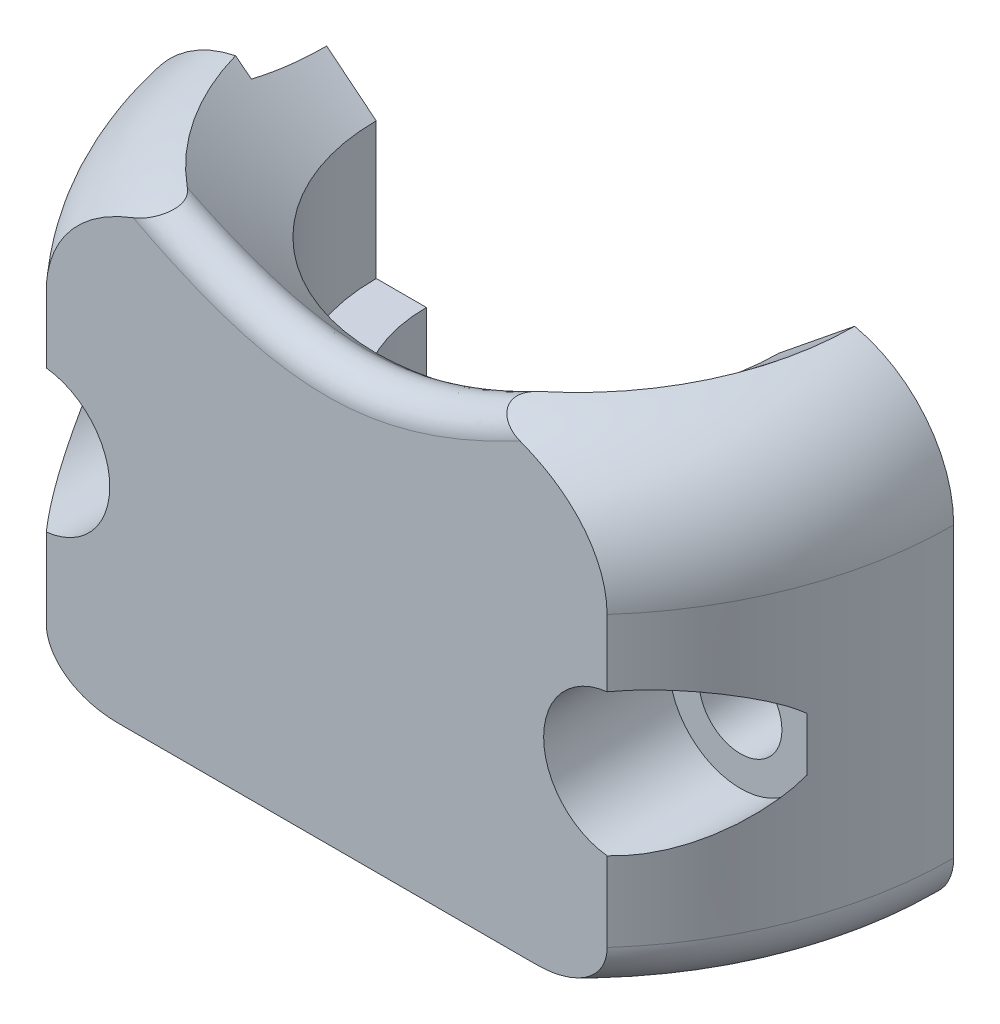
ISO-10303-21;
HEADER;
FILE_DESCRIPTION(('STEP AP214'),'2;1');
FILE_NAME('part.step','',(''),(''),'','','');
FILE_SCHEMA(('AUTOMOTIVE_DESIGN { 1 0 10303 214 1 1 1 1 }'));
ENDSEC;
DATA;
#1=APPLICATION_CONTEXT('core data for automotive mechanical design processes');
#2=APPLICATION_PROTOCOL_DEFINITION('international standard','automotive_design',2000,#1);
#3=PRODUCT_CONTEXT('',#1,'mechanical');
#4=PRODUCT('Part','Part','',(#3));
#5=PRODUCT_RELATED_PRODUCT_CATEGORY('part','',(#4));
#6=PRODUCT_DEFINITION_FORMATION('','',#4);
#7=PRODUCT_DEFINITION_CONTEXT('part definition',#1,'design');
#8=PRODUCT_DEFINITION('design','',#6,#7);
#9=PRODUCT_DEFINITION_SHAPE('','',#8);
#10=(LENGTH_UNIT() NAMED_UNIT(*) SI_UNIT(.MILLI.,.METRE.));
#11=(NAMED_UNIT(*) PLANE_ANGLE_UNIT() SI_UNIT($,.RADIAN.));
#12=(NAMED_UNIT(*) SI_UNIT($,.STERADIAN.) SOLID_ANGLE_UNIT());
#13=UNCERTAINTY_MEASURE_WITH_UNIT(LENGTH_MEASURE(1.E-05),#10,'distance_accuracy_value','');
#14=(GEOMETRIC_REPRESENTATION_CONTEXT(3) GLOBAL_UNCERTAINTY_ASSIGNED_CONTEXT((#13)) GLOBAL_UNIT_ASSIGNED_CONTEXT((#10,
#11,#12)) REPRESENTATION_CONTEXT('',''));
#15=CARTESIAN_POINT('',(0.,0.,0.));
#16=DIRECTION('',(0.,0.,1.));
#17=DIRECTION('',(1.,0.,0.));
#18=AXIS2_PLACEMENT_3D('',#15,#16,#17);
#19=CARTESIAN_POINT('',(0.,27.7493256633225,0.));
#20=DIRECTION('',(0.,1.,0.));
#21=DIRECTION('',(0.,0.,1.));
#22=AXIS2_PLACEMENT_3D('',#19,#20,#21);
#23=CYLINDRICAL_SURFACE('',#22,15.);
#24=CARTESIAN_POINT('',(0.,13.5,0.));
#25=DIRECTION('',(0.,-1.,0.));
#26=DIRECTION('',(0.,0.,-1.));
#27=AXIS2_PLACEMENT_3D('',#24,#25,#26);
#28=CIRCLE('',#27,15.);
#29=CARTESIAN_POINT('',(15.,13.5,0.));
#30=VERTEX_POINT('',#29);
#31=CARTESIAN_POINT('',(11.1803398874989,13.4999999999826,10.));
#32=VERTEX_POINT('',#31);
#33=EDGE_CURVE('E379',#30,#32,#28,.T.);
#34=ORIENTED_EDGE('',*,*,#33,.T.);
#35=DIRECTION('',(0.,1.,0.));
#36=VECTOR('',#35,1.);
#37=CARTESIAN_POINT('',(11.1803398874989,0.,10.));
#38=LINE('',#37,#36);
#39=CARTESIAN_POINT('',(11.1803398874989,10.8320164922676,10.));
#40=VERTEX_POINT('',#39);
#41=EDGE_CURVE('E477',#40,#32,#38,.T.);
#42=ORIENTED_EDGE('',*,*,#41,.F.);
#43=CARTESIAN_POINT('',(14.142135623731,6.93153411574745,5.));
#44=CARTESIAN_POINT('',(14.1207766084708,6.87879188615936,5.06042981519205));
#45=CARTESIAN_POINT('',(14.0984753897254,6.82811630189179,5.12225855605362));
#46=CARTESIAN_POINT('',(14.0521516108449,6.73035929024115,5.24799696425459));
#47=CARTESIAN_POINT('',(14.0281304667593,6.68327497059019,5.31190489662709));
#48=CARTESIAN_POINT('',(13.9785533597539,6.59218522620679,5.4410324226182));
#49=CARTESIAN_POINT('',(13.9530011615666,6.54817278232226,5.50624855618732));
#50=CARTESIAN_POINT('',(13.9003800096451,6.46273183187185,5.63777034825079));
#51=CARTESIAN_POINT('',(13.8733106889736,6.42130395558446,5.70407626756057));
#52=CARTESIAN_POINT('',(13.7897363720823,6.30021493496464,5.90458799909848));
#53=CARTESIAN_POINT('',(13.7310197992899,6.22402769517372,6.03998250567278));
#54=CARTESIAN_POINT('',(13.6078958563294,6.07951306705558,6.31249460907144));
#55=CARTESIAN_POINT('',(13.5434833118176,6.01119295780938,6.44961367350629));
#56=CARTESIAN_POINT('',(13.3755286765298,5.84953951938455,6.79321802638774));
#57=CARTESIAN_POINT('',(13.2685046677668,5.76074484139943,7.00016103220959));
#58=CARTESIAN_POINT('',(13.0420559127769,5.5991917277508,7.41352697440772));
#59=CARTESIAN_POINT('',(12.9226297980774,5.52643506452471,7.61994985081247));
#60=CARTESIAN_POINT('',(12.6714608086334,5.3980655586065,8.03068994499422));
#61=CARTESIAN_POINT('',(12.5397182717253,5.34245224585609,8.23500722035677));
#62=CARTESIAN_POINT('',(12.2643523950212,5.25057734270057,8.63976917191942));
#63=CARTESIAN_POINT('',(12.1207365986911,5.2143035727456,8.84021620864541));
#64=CARTESIAN_POINT('',(11.7929443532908,5.15932433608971,9.27436628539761));
#65=CARTESIAN_POINT('',(11.606323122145,5.14543128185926,9.50692192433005));
#66=CARTESIAN_POINT('',(11.3168567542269,5.15426085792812,9.8463668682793));
#67=CARTESIAN_POINT('',(11.2188523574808,5.16213270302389,9.95787404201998));
#68=CARTESIAN_POINT('',(11.0202735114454,5.18887884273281,10.177201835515));
#69=CARTESIAN_POINT('',(10.9196996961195,5.20775044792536,10.2850233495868));
#70=CARTESIAN_POINT('',(10.6633048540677,5.27091180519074,10.5519575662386));
#71=CARTESIAN_POINT('',(10.5063074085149,5.32335644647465,10.7081474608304));
#72=CARTESIAN_POINT('',(10.1933475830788,5.46143377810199,11.0064624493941));
#73=CARTESIAN_POINT('',(10.037384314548,5.54703273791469,11.1486016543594));
#74=CARTESIAN_POINT('',(9.76927678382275,5.73127477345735,11.3835586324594));
#75=CARTESIAN_POINT('',(9.65531611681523,5.82236794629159,11.480194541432));
#76=CARTESIAN_POINT('',(9.43758582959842,6.02738085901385,11.6598377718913));
#77=CARTESIAN_POINT('',(9.33380392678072,6.1412725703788,11.742861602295));
#78=CARTESIAN_POINT('',(9.15697120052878,6.37197068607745,11.8810999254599));
#79=CARTESIAN_POINT('',(9.08164863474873,6.48564139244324,11.9386272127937));
#80=CARTESIAN_POINT('',(8.94624582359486,6.72721553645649,12.0404265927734));
#81=CARTESIAN_POINT('',(8.88616182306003,6.85511545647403,12.084701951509));
#82=CARTESIAN_POINT('',(8.78453908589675,7.12286287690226,12.1587782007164));
#83=CARTESIAN_POINT('',(8.74309448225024,7.26276686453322,12.1885056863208));
#84=CARTESIAN_POINT('',(8.6819943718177,7.5496449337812,12.2321060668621));
#85=CARTESIAN_POINT('',(8.66233054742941,7.69661629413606,12.2459850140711));
#86=CARTESIAN_POINT('',(8.64690524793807,7.97875405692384,12.2568793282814));
#87=CARTESIAN_POINT('',(8.64910588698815,8.11375855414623,12.2553324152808));
#88=CARTESIAN_POINT('',(8.67242975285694,8.3812591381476,12.2388383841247));
#89=CARTESIAN_POINT('',(8.69354849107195,8.51375581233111,12.2238944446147));
#90=CARTESIAN_POINT('',(8.75281983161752,8.76967037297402,12.1815195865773));
#91=CARTESIAN_POINT('',(8.79059604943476,8.89322228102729,12.154364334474));
#92=CARTESIAN_POINT('',(8.88108570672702,9.1313825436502,12.0884008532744));
#93=CARTESIAN_POINT('',(8.93380141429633,9.24598953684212,12.0495908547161));
#94=CARTESIAN_POINT('',(9.05525352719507,9.47071552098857,11.9586143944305));
#95=CARTESIAN_POINT('',(9.12476748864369,9.58014110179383,11.9057807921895));
#96=CARTESIAN_POINT('',(9.27458154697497,9.78497564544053,11.7894498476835));
#97=CARTESIAN_POINT('',(9.35488542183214,9.88037967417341,11.7259487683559));
#98=CARTESIAN_POINT('',(9.53466301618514,10.068602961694,11.5803844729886));
#99=CARTESIAN_POINT('',(9.63525773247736,10.1592976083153,11.4969709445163));
#100=CARTESIAN_POINT('',(9.84244861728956,10.3221583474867,11.3201050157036));
#101=CARTESIAN_POINT('',(9.94904949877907,10.3943096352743,11.2266446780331));
#102=CARTESIAN_POINT('',(10.1416866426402,10.5074155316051,11.0525673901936));
#103=CARTESIAN_POINT('',(10.2272035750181,10.551742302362,10.9735234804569));
#104=CARTESIAN_POINT('',(10.3987600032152,10.6303374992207,10.8110955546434));
#105=CARTESIAN_POINT('',(10.4847997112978,10.664601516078,10.7277096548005));
#106=CARTESIAN_POINT('',(10.7424123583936,10.7534711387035,10.4718152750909));
#107=CARTESIAN_POINT('',(10.9133570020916,10.7940865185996,10.2936794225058));
#108=CARTESIAN_POINT('',(11.2009347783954,10.8368777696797,9.97853650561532));
#109=CARTESIAN_POINT('',(11.3193564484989,10.8466387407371,9.84400275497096));
#110=CARTESIAN_POINT('',(11.5514868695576,10.8518977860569,9.57054142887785));
#111=CARTESIAN_POINT('',(11.6651935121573,10.8473895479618,9.43161193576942));
#112=CARTESIAN_POINT('',(11.8874019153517,10.8257611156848,9.14997166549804));
#113=CARTESIAN_POINT('',(11.995886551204,10.8086020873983,9.00725055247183));
#114=CARTESIAN_POINT('',(12.2068389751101,10.7630629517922,8.7192289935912));
#115=CARTESIAN_POINT('',(12.3093071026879,10.7346834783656,8.5739286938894));
#116=CARTESIAN_POINT('',(12.545915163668,10.6550996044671,8.22554923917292));
#117=CARTESIAN_POINT('',(12.6772197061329,10.5993177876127,8.02158019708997));
#118=CARTESIAN_POINT('',(12.9276206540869,10.4706730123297,7.61146653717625));
#119=CARTESIAN_POINT('',(13.0467100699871,10.3978003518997,7.40532074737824));
#120=CARTESIAN_POINT('',(13.2721418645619,10.2363362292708,6.99322202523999));
#121=CARTESIAN_POINT('',(13.3785273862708,10.1478006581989,6.7872709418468));
#122=CARTESIAN_POINT('',(13.5287597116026,10.0028612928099,6.47963802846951));
#123=CARTESIAN_POINT('',(13.5772733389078,9.95253341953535,6.37732361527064));
#124=CARTESIAN_POINT('',(13.6711652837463,9.84756779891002,6.17347686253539));
#125=CARTESIAN_POINT('',(13.7165441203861,9.79293076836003,6.0719443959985));
#126=CARTESIAN_POINT('',(13.7968739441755,9.68833322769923,5.88682455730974));
#127=CARTESIAN_POINT('',(13.8323095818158,9.63909006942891,5.80304219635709));
#128=CARTESIAN_POINT('',(13.9008633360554,9.53692537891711,5.63684940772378));
#129=CARTESIAN_POINT('',(13.9339828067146,9.48400603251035,5.55443820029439));
#130=CARTESIAN_POINT('',(13.9978148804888,9.3738553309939,5.39155092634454));
#131=CARTESIAN_POINT('',(14.0285273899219,9.31662380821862,5.31107493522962));
#132=CARTESIAN_POINT('',(14.0726466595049,9.22682573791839,5.19253310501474));
#133=CARTESIAN_POINT('',(14.087037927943,9.19621086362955,5.15335346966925));
#134=CARTESIAN_POINT('',(14.1151225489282,9.13349434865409,5.07592531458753));
#135=CARTESIAN_POINT('',(14.1288156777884,9.10139223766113,5.03767709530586));
#136=CARTESIAN_POINT('',(14.142135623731,9.0684658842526,4.99999999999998));
#137=B_SPLINE_CURVE_WITH_KNOTS('',3,(#43,#44,#45,#46,#47,#48,#49,#50,#51,#52,#53,#54,#55,#56,
#57,#58,#59,#60,#61,#62,#63,#64,#65,#66,#67,#68,#69,#70,#71,#72,#73,#74,#75,#76,#77,#78,#79,#80,
#81,#82,#83,#84,#85,#86,#87,#88,#89,#90,#91,#92,#93,#94,#95,#96,#97,#98,#99,#100,#101,#102,#103,
#104,#105,#106,#107,#108,#109,#110,#111,#112,#113,#114,#115,#116,#117,#118,#119,#120,#121,#122,
#123,#124,#125,#126,#127,#128,#129,#130,#131,#132,#133,#134,#135,#136),.UNSPECIFIED.,.F.,.F.,(4,
2,2,2,2,2,2,2,2,2,2,2,2,2,2,2,2,2,2,2,2,2,2,2,2,2,2,2,2,2,2,2,2,2,2,2,2,2,2,2,2,2,2,2,2,2,4),
(0.,0.248894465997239,0.497586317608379,0.745689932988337,0.993853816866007,1.49172594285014,
1.99005508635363,2.73714824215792,3.48432392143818,4.23147911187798,4.97816320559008,
5.87062212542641,6.3162147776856,6.76169852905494,7.44201009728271,8.12163134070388,
8.64466021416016,9.16704998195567,9.60918747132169,10.051215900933,10.4954522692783,
10.9395189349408,11.3426153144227,11.7456160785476,12.1399434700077,12.5343307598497,
12.9526299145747,13.3710759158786,13.846554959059,14.3224124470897,14.6957145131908,
15.0691799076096,15.8166356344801,16.3545042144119,16.8926107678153,17.4323760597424,
17.97211086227,18.7178095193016,19.4639325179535,20.2074448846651,20.5790967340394,
20.9506868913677,21.2609233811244,21.570976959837,21.8810426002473,22.0363015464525,
22.191609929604),.UNSPECIFIED.);
#138=CARTESIAN_POINT('',(14.142135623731,9.06846588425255,5.));
#139=VERTEX_POINT('',#138);
#140=EDGE_CURVE('E406',#40,#139,#137,.T.);
#141=ORIENTED_EDGE('',*,*,#140,.T.);
#142=DIRECTION('',(0.,1.,0.));
#143=VECTOR('',#142,1.);
#144=CARTESIAN_POINT('',(14.142135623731,27.7493256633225,5.));
#145=LINE('',#144,#143);
#146=CARTESIAN_POINT('',(14.142135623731,6.93153411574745,5.));
#147=VERTEX_POINT('',#146);
#148=EDGE_CURVE('E310',#147,#139,#145,.T.);
#149=ORIENTED_EDGE('',*,*,#148,.F.);
#150=CARTESIAN_POINT('',(11.1803398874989,5.16798350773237,10.));
#151=VERTEX_POINT('',#150);
#152=EDGE_CURVE('E491',#147,#151,#137,.T.);
#153=ORIENTED_EDGE('',*,*,#152,.T.);
#154=CARTESIAN_POINT('',(11.1803398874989,2.,10.));
#155=VERTEX_POINT('',#154);
#156=EDGE_CURVE('E478',#155,#151,#38,.T.);
#157=ORIENTED_EDGE('',*,*,#156,.F.);
#158=CARTESIAN_POINT('',(0.,2.,0.));
#159=DIRECTION('',(0.,1.,0.));
#160=DIRECTION('',(0.,0.,1.));
#161=AXIS2_PLACEMENT_3D('',#158,#159,#160);
#162=CIRCLE('',#161,15.);
#163=CARTESIAN_POINT('',(15.,2.,0.));
#164=VERTEX_POINT('',#163);
#165=EDGE_CURVE('E382',#155,#164,#162,.T.);
#166=ORIENTED_EDGE('',*,*,#165,.T.);
#167=DIRECTION('',(0.,1.,0.));
#168=VECTOR('',#167,1.);
#169=CARTESIAN_POINT('',(15.,18.5,0.));
#170=LINE('',#169,#168);
#171=EDGE_CURVE('E328',#164,#30,#170,.T.);
#172=ORIENTED_EDGE('',*,*,#171,.T.);
#173=EDGE_LOOP('',(#34,#42,#141,#149,#153,#157,#166,#172));
#174=FACE_BOUND('',#173,.T.);
#175=ADVANCED_FACE('F33',(#174),#23,.T.);
#176=CARTESIAN_POINT('',(0.,13.5,0.));
#177=DIRECTION('',(0.,-1.,0.));
#178=DIRECTION('',(0.,0.,-1.));
#179=AXIS2_PLACEMENT_3D('',#176,#177,#178);
#180=TOROIDAL_SURFACE('',#179,10.,5.);
#181=CARTESIAN_POINT('',(0.,18.5000000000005,10.));
#182=CARTESIAN_POINT('',(-0.19092234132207,18.4999977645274,10.));
#183=CARTESIAN_POINT('',(-0.381844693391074,18.5000083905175,10.));
#184=CARTESIAN_POINT('',(-0.763689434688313,18.4999378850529,10.));
#185=CARTESIAN_POINT('',(-0.954611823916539,18.4998567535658,10.));
#186=CARTESIAN_POINT('',(-1.33652232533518,18.4992877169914,10.));
#187=CARTESIAN_POINT('',(-1.52751043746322,18.4987996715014,10.));
#188=CARTESIAN_POINT('',(-1.90948379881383,18.4969018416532,10.));
#189=CARTESIAN_POINT('',(-2.10046904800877,18.4954920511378,10.));
#190=CARTESIAN_POINT('',(-2.48234600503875,18.4910651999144,10.));
#191=CARTESIAN_POINT('',(-2.67323771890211,18.4880488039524,10.));
#192=CARTESIAN_POINT('',(-3.0549651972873,18.4795665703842,10.));
#193=CARTESIAN_POINT('',(-3.24580096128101,18.4741007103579,10.));
#194=CARTESIAN_POINT('',(-3.81802313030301,18.4526223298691,10.));
#195=CARTESIAN_POINT('',(-4.19926726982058,18.4315287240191,10.));
#196=CARTESIAN_POINT('',(-4.84691734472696,18.3765327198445,10.));
#197=CARTESIAN_POINT('',(-5.11376874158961,18.3483025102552,10.));
#198=CARTESIAN_POINT('',(-5.64551523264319,18.2773788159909,10.));
#199=CARTESIAN_POINT('',(-5.91040994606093,18.2346825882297,10.));
#200=CARTESIAN_POINT('',(-6.69888340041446,18.0796696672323,10.));
#201=CARTESIAN_POINT('',(-7.21812117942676,17.9403212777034,10.));
#202=CARTESIAN_POINT('',(-8.02332059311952,17.6356590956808,10.));
#203=CARTESIAN_POINT('',(-8.32109659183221,17.5018132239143,10.));
#204=CARTESIAN_POINT('',(-8.89393414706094,17.191431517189,10.));
#205=CARTESIAN_POINT('',(-9.16901210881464,17.0149268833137,10.));
#206=CARTESIAN_POINT('',(-9.63674743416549,16.652783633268,10.));
#207=CARTESIAN_POINT('',(-9.83526665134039,16.4747637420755,10.));
#208=CARTESIAN_POINT('',(-10.2005397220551,16.0885557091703,10.));
#209=CARTESIAN_POINT('',(-10.3673283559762,15.8804010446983,10.));
#210=CARTESIAN_POINT('',(-10.637998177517,15.4706902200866,10.));
#211=CARTESIAN_POINT('',(-10.7475814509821,15.2729110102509,10.));
#212=CARTESIAN_POINT('',(-10.9322160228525,14.86175197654,10.));
#213=CARTESIAN_POINT('',(-11.0072797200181,14.6483777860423,10.));
#214=CARTESIAN_POINT('',(-11.1189285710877,14.210843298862,10.));
#215=CARTESIAN_POINT('',(-11.1553676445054,13.986645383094,10.));
#216=CARTESIAN_POINT('',(-11.1870183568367,13.5353431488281,10.));
#217=CARTESIAN_POINT('',(-11.1822357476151,13.3082392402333,10.));
#218=CARTESIAN_POINT('',(-11.1334903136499,12.8738775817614,10.));
#219=CARTESIAN_POINT('',(-11.0921893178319,12.6663137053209,10.));
#220=CARTESIAN_POINT('',(-10.9762370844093,12.2608292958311,10.));
#221=CARTESIAN_POINT('',(-10.9015917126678,12.062907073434,10.));
#222=CARTESIAN_POINT('',(-10.7200237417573,11.6758054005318,10.));
#223=CARTESIAN_POINT('',(-10.6122570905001,11.487025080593,10.));
#224=CARTESIAN_POINT('',(-10.3698640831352,11.127450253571,10.));
#225=CARTESIAN_POINT('',(-10.2352127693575,10.9566726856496,10.));
#226=CARTESIAN_POINT('',(-9.98849923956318,10.6841204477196,10.));
#227=CARTESIAN_POINT('',(-9.88204987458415,10.5771726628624,10.));
#228=CARTESIAN_POINT('',(-9.66013966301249,10.3730505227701,10.));
#229=CARTESIAN_POINT('',(-9.54467603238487,10.2758792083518,10.));
#230=CARTESIAN_POINT('',(-9.1869629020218,9.99907407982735,10.));
#231=CARTESIAN_POINT('',(-8.93327379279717,9.83402295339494,10.));
#232=CARTESIAN_POINT('',(-8.47865498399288,9.5812982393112,10.));
#233=CARTESIAN_POINT('',(-8.2824189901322,9.48483049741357,10.));
#234=CARTESIAN_POINT('',(-7.88206696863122,9.30954674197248,10.));
#235=CARTESIAN_POINT('',(-7.67794594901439,9.23074213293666,10.));
#236=CARTESIAN_POINT('',(-7.26365941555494,9.08889459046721,10.));
#237=CARTESIAN_POINT('',(-7.05347680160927,9.02590238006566,10.));
#238=CARTESIAN_POINT('',(-6.62960955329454,8.91409161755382,10.));
#239=CARTESIAN_POINT('',(-6.41592785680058,8.86526176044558,10.));
#240=CARTESIAN_POINT('',(-5.8119058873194,8.74502944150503,10.));
#241=CARTESIAN_POINT('',(-5.41883343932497,8.68743535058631,10.));
#242=CARTESIAN_POINT('',(-4.62946073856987,8.60048170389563,10.));
#243=CARTESIAN_POINT('',(-4.23315713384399,8.57115666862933,10.));
#244=CARTESIAN_POINT('',(-3.63722730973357,8.54052025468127,10.));
#245=CARTESIAN_POINT('',(-3.43789129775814,8.53253050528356,10.));
#246=CARTESIAN_POINT('',(-3.0391112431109,8.51989696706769,10.));
#247=CARTESIAN_POINT('',(-2.83966719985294,8.51525319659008,10.));
#248=CARTESIAN_POINT('',(-2.44084072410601,8.50825977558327,10.));
#249=CARTESIAN_POINT('',(-2.24145830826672,8.50590902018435,10.));
#250=CARTESIAN_POINT('',(-1.84268453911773,8.50261259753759,10.));
#251=CARTESIAN_POINT('',(-1.64329318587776,8.50166692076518,10.));
#252=CARTESIAN_POINT('',(-1.2419445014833,8.50047664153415,10.));
#253=CARTESIAN_POINT('',(-1.03998715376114,8.50024121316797,10.));
#254=CARTESIAN_POINT('',(-0.636072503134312,8.50000453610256,10.));
#255=CARTESIAN_POINT('',(-0.434115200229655,8.50000328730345,10.));
#256=CARTESIAN_POINT('',(-0.0301734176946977,8.49999816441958,10.));
#257=CARTESIAN_POINT('',(0.17181106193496,8.49999428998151,10.));
#258=CARTESIAN_POINT('',(0.57577966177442,8.50001546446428,10.));
#259=CARTESIAN_POINT('',(0.777763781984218,8.50004051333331,10.));
#260=CARTESIAN_POINT('',(1.18127143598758,8.50041757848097,10.));
#261=CARTESIAN_POINT('',(1.38279496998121,8.50076884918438,10.));
#262=CARTESIAN_POINT('',(1.78584212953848,8.50234292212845,10.));
#263=CARTESIAN_POINT('',(1.98736575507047,8.50356573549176,10.));
#264=CARTESIAN_POINT('',(2.39037298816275,8.50765112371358,10.));
#265=CARTESIAN_POINT('',(2.59185659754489,8.51051348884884,10.));
#266=CARTESIAN_POINT('',(2.99476785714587,8.51883717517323,10.));
#267=CARTESIAN_POINT('',(3.19619550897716,8.52429841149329,10.));
#268=CARTESIAN_POINT('',(3.59974819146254,8.53896805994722,10.));
#269=CARTESIAN_POINT('',(3.80187270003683,8.54819172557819,10.));
#270=CARTESIAN_POINT('',(4.20584526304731,8.57165012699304,10.));
#271=CARTESIAN_POINT('',(4.40769330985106,8.58588499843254,10.));
#272=CARTESIAN_POINT('',(4.81107561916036,8.62075321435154,10.));
#273=CARTESIAN_POINT('',(5.01260931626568,8.64139337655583,10.));
#274=CARTESIAN_POINT('',(5.41470570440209,8.6905211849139,10.));
#275=CARTESIAN_POINT('',(5.61526842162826,8.71900861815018,10.));
#276=CARTESIAN_POINT('',(6.20794377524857,8.81738456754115,10.));
#277=CARTESIAN_POINT('',(6.59800988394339,8.90068835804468,10.));
#278=CARTESIAN_POINT('',(7.36441225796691,9.11521368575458,10.));
#279=CARTESIAN_POINT('',(7.74078124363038,9.24631147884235,10.));
#280=CARTESIAN_POINT('',(8.34861358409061,9.51480976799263,10.));
#281=CARTESIAN_POINT('',(8.58715371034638,9.63607428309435,10.));
#282=CARTESIAN_POINT('',(9.04789277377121,9.90841673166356,10.));
#283=CARTESIAN_POINT('',(9.27003405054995,10.0595935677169,10.));
#284=CARTESIAN_POINT('',(9.69140277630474,10.3943232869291,10.));
#285=CARTESIAN_POINT('',(9.89046925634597,10.5780833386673,10.));
#286=CARTESIAN_POINT('',(10.1635933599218,10.8765756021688,10.));
#287=CARTESIAN_POINT('',(10.2503572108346,10.9798328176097,10.));
#288=CARTESIAN_POINT('',(10.4143387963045,11.1936493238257,10.));
#289=CARTESIAN_POINT('',(10.4915583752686,11.304207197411,10.));
#290=CARTESIAN_POINT('',(10.6825704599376,11.607156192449,10.));
#291=CARTESIAN_POINT('',(10.7870454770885,11.8055757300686,10.));
#292=CARTESIAN_POINT('',(10.961405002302,12.2170898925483,10.));
#293=CARTESIAN_POINT('',(11.0312962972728,12.430181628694,10.));
#294=CARTESIAN_POINT('',(11.1328611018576,12.8661572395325,10.));
#295=CARTESIAN_POINT('',(11.1644032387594,13.0890720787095,10.));
#296=CARTESIAN_POINT('',(11.1868893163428,13.5369300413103,10.));
#297=CARTESIAN_POINT('',(11.1778404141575,13.761872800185,10.));
#298=CARTESIAN_POINT('',(11.1215099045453,14.1929974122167,10.));
#299=CARTESIAN_POINT('',(11.0765709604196,14.3994917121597,10.));
#300=CARTESIAN_POINT('',(10.9537515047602,14.8023583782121,10.));
#301=CARTESIAN_POINT('',(10.8758716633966,14.998730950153,10.));
#302=CARTESIAN_POINT('',(10.6877142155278,15.3834439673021,10.));
#303=CARTESIAN_POINT('',(10.576430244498,15.571288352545,10.));
#304=CARTESIAN_POINT('',(10.3273359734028,15.92850516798,10.));
#305=CARTESIAN_POINT('',(10.1895102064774,16.0978667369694,10.));
#306=CARTESIAN_POINT('',(9.93684460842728,16.3687300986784,10.));
#307=CARTESIAN_POINT('',(9.82743606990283,16.4753908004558,10.));
#308=CARTESIAN_POINT('',(9.59963284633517,16.6786842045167,10.));
#309=CARTESIAN_POINT('',(9.48123531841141,16.7753137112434,10.));
#310=CARTESIAN_POINT('',(9.11464328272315,17.0503186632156,10.));
#311=CARTESIAN_POINT('',(8.85514190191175,17.2137140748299,10.));
#312=CARTESIAN_POINT('',(8.19155526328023,17.5700188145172,10.));
#313=CARTESIAN_POINT('',(7.77614622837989,17.741579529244,10.));
#314=CARTESIAN_POINT('',(7.13783586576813,17.949719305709,10.));
#315=CARTESIAN_POINT('',(6.9222146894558,18.0109510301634,10.));
#316=CARTESIAN_POINT('',(6.48738398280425,18.1191379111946,10.));
#317=CARTESIAN_POINT('',(6.26817479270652,18.1660944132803,10.));
#318=CARTESIAN_POINT('',(5.80003162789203,18.2529085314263,10.));
#319=CARTESIAN_POINT('',(5.55080569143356,18.2911462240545,10.));
#320=CARTESIAN_POINT('',(5.05077608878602,18.3551441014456,10.));
#321=CARTESIAN_POINT('',(4.79997225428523,18.3809029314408,10.));
#322=CARTESIAN_POINT('',(4.29718991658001,18.422777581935,10.));
#323=CARTESIAN_POINT('',(4.04521017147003,18.4388777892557,10.));
#324=CARTESIAN_POINT('',(3.54093015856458,18.4639888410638,10.));
#325=CARTESIAN_POINT('',(3.28862990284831,18.4729999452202,10.));
#326=CARTESIAN_POINT('',(2.7832124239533,18.4862938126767,10.));
#327=CARTESIAN_POINT('',(2.53009488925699,18.4905632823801,10.));
#328=CARTESIAN_POINT('',(2.02383512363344,18.4963257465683,10.));
#329=CARTESIAN_POINT('',(1.77069289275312,18.4978187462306,10.));
#330=CARTESIAN_POINT('',(1.26462458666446,18.4995584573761,10.));
#331=CARTESIAN_POINT('',(1.01169851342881,18.4998062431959,10.));
#332=CARTESIAN_POINT('',(0.505848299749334,18.5000284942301,10.));
#333=CARTESIAN_POINT('',(0.252924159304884,18.500002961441,10.));
#334=CARTESIAN_POINT('',(0.,18.5000000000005,10.));
#335=B_SPLINE_CURVE_WITH_KNOTS('',3,(#181,#182,#183,#184,#185,#186,#187,#188,#189,#190,#191,
#192,#193,#194,#195,#196,#197,#198,#199,#200,#201,#202,#203,#204,#205,#206,#207,#208,#209,#210,
#211,#212,#213,#214,#215,#216,#217,#218,#219,#220,#221,#222,#223,#224,#225,#226,#227,#228,#229,
#230,#231,#232,#233,#234,#235,#236,#237,#238,#239,#240,#241,#242,#243,#244,#245,#246,#247,#248,
#249,#250,#251,#252,#253,#254,#255,#256,#257,#258,#259,#260,#261,#262,#263,#264,#265,#266,#267,
#268,#269,#270,#271,#272,#273,#274,#275,#276,#277,#278,#279,#280,#281,#282,#283,#284,#285,#286,
#287,#288,#289,#290,#291,#292,#293,#294,#295,#296,#297,#298,#299,#300,#301,#302,#303,#304,#305,
#306,#307,#308,#309,#310,#311,#312,#313,#314,#315,#316,#317,#318,#319,#320,#321,#322,#323,#324,
#325,#326,#327,#328,#329,#330,#331,#332,#333,#334),.UNSPECIFIED.,.T.,.F.,(4,2,2,2,2,2,2,2,2,2,2,
2,2,2,2,2,2,2,2,2,2,2,2,2,2,2,2,2,2,2,2,2,2,2,2,2,2,2,2,2,2,2,2,2,2,2,2,2,2,2,2,2,2,2,2,2,2,2,2,
2,2,2,2,2,2,2,2,2,2,2,2,2,2,2,2,2,4),(0.,0.572767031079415,1.14553426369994,1.71849920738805,
2.29146797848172,2.86419986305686,3.43693699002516,4.58198281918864,5.38661880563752,
6.19140745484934,7.79539647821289,8.77208640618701,9.74806412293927,10.5449587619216,
11.340974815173,12.0164084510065,12.6915992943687,13.3693347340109,14.04697560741,
14.6789544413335,15.3108221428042,15.9603554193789,16.6104945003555,17.0625970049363,
17.5148396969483,18.4188147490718,19.0740164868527,19.7296400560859,20.3873406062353,
21.0445146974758,22.2346376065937,23.4262119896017,24.0246793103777,24.6231499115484,
25.221332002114,25.8195100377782,26.4253821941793,27.0312540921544,27.6372075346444,
28.2431598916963,28.8477307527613,29.4523093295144,30.0568105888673,30.6612921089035,
31.2682490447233,31.8752224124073,32.482844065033,33.0904492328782,34.284775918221,
35.4760320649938,36.2770124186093,37.0806867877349,37.8896673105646,38.2938129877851,
38.697880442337,39.3675082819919,40.0370046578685,40.7087881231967,41.3804531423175,
42.0115428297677,42.6426196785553,43.2950337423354,43.9478291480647,44.4056329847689,
44.8635822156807,45.7798765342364,47.1203146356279,47.7924526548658,48.4645273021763,
49.2205708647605,49.9766964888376,50.7340411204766,51.491358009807,52.2507927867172,
53.0102261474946,53.769004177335,54.5277766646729),.UNSPECIFIED.);
#336=CARTESIAN_POINT('',(-7.7146450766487,17.7524510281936,10.));
#337=VERTEX_POINT('',#336);
#338=CARTESIAN_POINT('',(-11.1803398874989,13.5000000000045,10.));
#339=VERTEX_POINT('',#338);
#340=EDGE_CURVE('E306',#337,#339,#335,.T.);
#341=ORIENTED_EDGE('',*,*,#340,.F.);
#342=CARTESIAN_POINT('',(-19.8055508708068,25.7523126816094,10.));
#343=CARTESIAN_POINT('',(-19.5131029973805,26.1498615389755,10.));
#344=CARTESIAN_POINT('',(-19.3352151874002,26.391679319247,9.60827185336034));
#345=CARTESIAN_POINT('',(-19.1573273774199,26.6334970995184,9.21654370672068));
#346=CARTESIAN_POINT('',(-19.2333669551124,26.5301301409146,8.73998929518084));
#347=CARTESIAN_POINT('',(-19.3765164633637,25.4367360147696,10.));
#348=CARTESIAN_POINT('',(-19.0836404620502,25.8358352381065,10.));
#349=CARTESIAN_POINT('',(-18.9064446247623,26.0781219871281,9.60635188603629));
#350=CARTESIAN_POINT('',(-18.7287628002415,26.3200485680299,9.21270184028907));
#351=CARTESIAN_POINT('',(-18.8064586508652,26.2145534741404,8.73531898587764));
#352=CARTESIAN_POINT('',(-18.946670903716,25.1222547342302,10.));
#353=CARTESIAN_POINT('',(-18.65358467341,25.5231669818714,10.));
#354=CARTESIAN_POINT('',(-18.4769211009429,25.7657850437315,9.60432894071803));
#355=CARTESIAN_POINT('',(-18.299688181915,26.0079907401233,9.20865510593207));
#356=CARTESIAN_POINT('',(-18.3789056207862,25.9000721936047,8.73041803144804));
#357=CARTESIAN_POINT('',(-18.0849675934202,24.4960223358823,10.));
#358=CARTESIAN_POINT('',(-17.7916042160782,24.9008838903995,10.));
#359=CARTESIAN_POINT('',(-17.6160433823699,25.1441564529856,9.60003566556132));
#360=CARTESIAN_POINT('',(-17.4398984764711,25.3870085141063,9.20006835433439));
#361=CARTESIAN_POINT('',(-17.5222271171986,25.2738397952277,8.72007607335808));
#362=CARTESIAN_POINT('',(-17.653109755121,24.1842713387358,10.));
#363=CARTESIAN_POINT('',(-17.359609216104,24.5912243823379,10.));
#364=CARTESIAN_POINT('',(-17.1846891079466,24.8348649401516,9.59776532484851));
#365=CARTESIAN_POINT('',(-17.0091135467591,25.0780396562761,9.19552697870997));
#366=CARTESIAN_POINT('',(-17.0931015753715,24.9620887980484,8.71463504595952));
#367=CARTESIAN_POINT('',(-16.7863113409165,23.5635523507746,10.));
#368=CARTESIAN_POINT('',(-16.492708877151,23.9750700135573,10.));
#369=CARTESIAN_POINT('',(-16.3191455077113,24.219449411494,9.59293198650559));
#370=CARTESIAN_POINT('',(-16.1449264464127,24.4633624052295,9.18586032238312));
#371=CARTESIAN_POINT('',(-16.2323192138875,24.3413698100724,8.70312504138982));
#372=CARTESIAN_POINT('',(-16.351366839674,23.2545898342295,10.));
#373=CARTESIAN_POINT('',(-16.0577173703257,23.6685305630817,10.));
#374=CARTESIAN_POINT('',(-15.8849526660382,23.9133315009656,9.59036850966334));
#375=CARTESIAN_POINT('',(-15.7114392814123,24.1576098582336,9.18073232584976));
#376=CARTESIAN_POINT('',(-15.8006593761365,24.0324072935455,8.69705503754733));
#377=CARTESIAN_POINT('',(-15.4786160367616,22.6407439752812,10.));
#378=CARTESIAN_POINT('',(-15.1851223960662,23.0599992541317,10.));
#379=CARTESIAN_POINT('',(-15.0140547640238,23.3056447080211,9.5848997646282));
#380=CARTESIAN_POINT('',(-14.8422358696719,23.5507661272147,9.16979480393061));
#381=CARTESIAN_POINT('',(-14.9351775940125,23.418561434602,8.68420047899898));
#382=CARTESIAN_POINT('',(-15.0408097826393,22.3358605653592,10.));
#383=CARTESIAN_POINT('',(-14.7474184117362,22.757948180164,10.));
#384=CARTESIAN_POINT('',(-14.5773497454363,23.0040757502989,9.58199450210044));
#385=CARTESIAN_POINT('',(-14.4064201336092,23.2496161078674,9.163982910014));
#386=CARTESIAN_POINT('',(-14.5013556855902,23.1136780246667,8.6774159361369));
#387=CARTESIAN_POINT('',(-14.1445495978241,21.7193676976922,10.));
#388=CARTESIAN_POINT('',(-13.8516910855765,22.1477948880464,10.));
#389=CARTESIAN_POINT('',(-13.6838416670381,22.3949348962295,9.57565938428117));
#390=CARTESIAN_POINT('',(-13.515059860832,22.641439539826,9.15131214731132));
#391=CARTESIAN_POINT('',(-13.6141370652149,22.4971851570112,8.66274656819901));
#392=CARTESIAN_POINT('',(-13.6859565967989,21.4079600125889,10.));
#393=CARTESIAN_POINT('',(-13.3934436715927,21.8398668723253,10.));
#394=CARTESIAN_POINT('',(-13.226919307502,22.0875879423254,9.57221348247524));
#395=CARTESIAN_POINT('',(-13.0593129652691,22.3345931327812,9.14441824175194));
#396=CARTESIAN_POINT('',(-13.1606370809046,22.1857774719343,8.65482913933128));
#397=CARTESIAN_POINT('',(-12.7640958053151,20.792147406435,10.));
#398=CARTESIAN_POINT('',(-12.4728365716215,21.2317963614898,10.));
#399=CARTESIAN_POINT('',(-12.3091858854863,21.4806891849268,9.56480549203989));
#400=CARTESIAN_POINT('',(-12.1444499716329,21.7288647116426,9.12960221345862));
#401=CARTESIAN_POINT('',(-12.2502400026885,21.5699648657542,8.63798300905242));
#402=CARTESIAN_POINT('',(-12.300828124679,20.4877423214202,10.));
#403=CARTESIAN_POINT('',(-12.0103115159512,20.9315692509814,10.));
#404=CARTESIAN_POINT('',(-11.8483749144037,21.1811371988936,9.56084341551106));
#405=CARTESIAN_POINT('',(-11.6851712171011,21.4298988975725,9.1216751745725));
#406=CARTESIAN_POINT('',(-11.7933429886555,21.2655597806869,8.62905433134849));
#407=CARTESIAN_POINT('',(-11.3687282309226,19.8882444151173,10.));
#408=CARTESIAN_POINT('',(-11.0805366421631,20.3414079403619,10.));
#409=CARTESIAN_POINT('',(-10.9223581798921,20.5923447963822,9.55231593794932));
#410=CARTESIAN_POINT('',(-10.7629102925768,20.8424750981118,9.10462017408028));
#411=CARTESIAN_POINT('',(-10.8756798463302,20.666061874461,8.61006941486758));
#412=CARTESIAN_POINT('',(-10.8998999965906,19.5931454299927,10.));
#413=CARTESIAN_POINT('',(-10.6130890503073,20.0513756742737,10.));
#414=CARTESIAN_POINT('',(-10.4571556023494,20.3030975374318,9.54775094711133));
#415=CARTESIAN_POINT('',(-10.2997339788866,20.5539200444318,9.0954862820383));
#416=CARTESIAN_POINT('',(-10.4149165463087,20.370962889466,8.60001394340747));
#417=CARTESIAN_POINT('',(-9.95485506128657,19.0150693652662,10.));
#418=CARTESIAN_POINT('',(-9.67208304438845,19.4846589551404,10.));
#419=CARTESIAN_POINT('',(-9.5211353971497,19.7379859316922,9.53792769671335));
#420=CARTESIAN_POINT('',(-9.36869610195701,19.9904132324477,9.07583973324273));
#421=CARTESIAN_POINT('',(-9.48828020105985,19.7928868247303,8.57868417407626));
#422=CARTESIAN_POINT('',(-9.47863913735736,18.7320910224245,10.));
#423=CARTESIAN_POINT('',(-9.19828612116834,19.2078834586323,10.));
#424=CARTESIAN_POINT('',(-9.05031836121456,19.4621201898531,9.53266950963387));
#425=CARTESIAN_POINT('',(-8.90060275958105,19.715371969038,9.06531823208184));
#426=CARTESIAN_POINT('',(-9.02240769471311,19.5099084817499,8.56741000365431));
#427=CARTESIAN_POINT('',(-8.52283549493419,18.186049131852,10.));
#428=CARTESIAN_POINT('',(-8.24927921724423,18.6756632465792,10.));
#429=CARTESIAN_POINT('',(-8.10795372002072,18.9317545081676,9.5214732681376));
#430=CARTESIAN_POINT('',(-7.96492129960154,19.1868863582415,9.04292627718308));
#431=CARTESIAN_POINT('',(-8.09021105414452,18.9638665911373,8.54380698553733));
#432=CARTESIAN_POINT('',(-8.0433666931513,17.9227788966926,10.));
#433=CARTESIAN_POINT('',(-7.77387647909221,18.4199115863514,10.));
#434=CARTESIAN_POINT('',(-7.63649074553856,18.6770283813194,9.51554465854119));
#435=CARTESIAN_POINT('',(-7.49712606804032,18.9331334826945,9.03106309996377));
#436=CARTESIAN_POINT('',(-7.6239672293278,18.7005963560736,8.53149328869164));
#437=CARTESIAN_POINT('',(-7.07251167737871,17.4182841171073,10.));
#438=CARTESIAN_POINT('',(-6.81416201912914,17.9321009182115,10.));
#439=CARTESIAN_POINT('',(-6.68574776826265,18.1913592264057,9.50299123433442));
#440=CARTESIAN_POINT('',(-6.55535851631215,18.4496094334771,9.00595647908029));
#441=CARTESIAN_POINT('',(-6.6835604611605,18.1961015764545,8.50592207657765));
#442=CARTESIAN_POINT('',(-6.58111956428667,17.1770707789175,10.));
#443=CARTESIAN_POINT('',(-6.32957663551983,17.7000350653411,10.));
#444=CARTESIAN_POINT('',(-6.20646393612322,17.960428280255,9.49636606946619));
#445=CARTESIAN_POINT('',(-6.08112967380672,18.2198338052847,8.99270050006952));
#446=CARTESIAN_POINT('',(-6.20939363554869,17.9548882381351,8.49266408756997));
#447=CARTESIAN_POINT('',(-5.58831685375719,16.7278621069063,10.));
#448=CARTESIAN_POINT('',(-5.35491811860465,17.2705470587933,10.));
#449=CARTESIAN_POINT('',(-5.24393997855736,17.5333145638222,9.48275348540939));
#450=CARTESIAN_POINT('',(-5.13078515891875,17.7951180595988,8.96547640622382));
#451=CARTESIAN_POINT('',(-5.25602399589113,17.5056795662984,8.46601100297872));
#452=CARTESIAN_POINT('',(-5.08702980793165,16.519597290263,10.));
#453=CARTESIAN_POINT('',(-4.86471402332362,17.0729149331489,10.));
#454=CARTESIAN_POINT('',(-4.76077001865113,17.336848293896,9.47576969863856));
#455=CARTESIAN_POINT('',(-4.65452756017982,17.5999679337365,8.95150692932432));
#456=CARTESIAN_POINT('',(-4.77690031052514,17.2974147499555,8.45261808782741));
#457=CARTESIAN_POINT('',(-4.06862403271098,16.1466048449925,10.));
#458=CARTESIAN_POINT('',(-3.87499486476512,16.7216281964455,10.));
#459=CARTESIAN_POINT('',(-3.78726416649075,16.9880201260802,9.46211330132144));
#460=CARTESIAN_POINT('',(-3.69730667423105,17.2536042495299,8.92419559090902));
#461=CARTESIAN_POINT('',(-3.80887740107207,16.9244223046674,8.42700643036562));
#462=CARTESIAN_POINT('',(-3.5515267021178,15.9818210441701,10.));
#463=CARTESIAN_POINT('',(-3.37552842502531,16.5681497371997,10.));
#464=CARTESIAN_POINT('',(-3.29693839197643,16.835601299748,9.45544029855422));
#465=CARTESIAN_POINT('',(-3.2164048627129,17.1025663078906,8.91085804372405));
#466=CARTESIAN_POINT('',(-3.31999167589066,16.7596385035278,8.41478618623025));
#467=CARTESIAN_POINT('',(-2.82886879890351,15.7956858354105,10.));
#468=CARTESIAN_POINT('',(-2.68306318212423,16.3961789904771,10.));
#469=CARTESIAN_POINT('',(-2.61806546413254,16.6649092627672,9.44740907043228));
#470=CARTESIAN_POINT('',(-2.55277197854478,16.9335643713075,8.8948144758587));
#471=CARTESIAN_POINT('',(-2.64029327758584,16.5735032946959,8.40033914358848));
#472=CARTESIAN_POINT('',(-2.62978520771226,15.7489081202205,10.));
#473=CARTESIAN_POINT('',(-2.49258900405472,16.3530929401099,10.));
#474=CARTESIAN_POINT('',(-2.43169344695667,16.6221987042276,9.44532849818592));
#475=CARTESIAN_POINT('',(-2.37054835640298,16.8912520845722,8.89065435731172));
#476=CARTESIAN_POINT('',(-2.45340460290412,16.5267255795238,8.39662732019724));
#477=CARTESIAN_POINT('',(-2.22967959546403,15.6646386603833,10.));
#478=CARTESIAN_POINT('',(-2.11068310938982,16.2756838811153,10.));
#479=CARTESIAN_POINT('',(-2.05834463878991,16.5455027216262,9.44150033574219));
#480=CARTESIAN_POINT('',(-2.0057606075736,16.8152722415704,8.88299823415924));
#481=CARTESIAN_POINT('',(-2.07844193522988,16.4424561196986,8.38983806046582));
#482=CARTESIAN_POINT('',(-2.0286576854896,15.6271463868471,10.));
#483=CARTESIAN_POINT('',(-1.91929373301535,16.2413808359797,10.));
#484=CARTESIAN_POINT('',(-1.87136788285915,16.5115168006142,9.43975272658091));
#485=CARTESIAN_POINT('',(-1.82323765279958,16.7816243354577,8.879503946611));
#486=CARTESIAN_POINT('',(-1.890368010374,16.4049638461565,8.38676058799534));
#487=CARTESIAN_POINT('',(-1.42385440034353,15.5299800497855,10.));
#488=CARTESIAN_POINT('',(-1.34438353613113,16.1526092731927,10.));
#489=CARTESIAN_POINT('',(-1.31043989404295,16.4236613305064,9.43515406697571));
#490=CARTESIAN_POINT('',(-1.27570869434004,16.694582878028,8.87030133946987));
#491=CARTESIAN_POINT('',(-1.32532273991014,16.3077975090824,8.37869859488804));
#492=CARTESIAN_POINT('',(-1.01747427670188,15.485387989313,10.));
#493=CARTESIAN_POINT('',(-0.960238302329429,16.1122705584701,10.));
#494=CARTESIAN_POINT('',(-0.93568289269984,16.3836859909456,9.43293683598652));
#495=CARTESIAN_POINT('',(-0.91085328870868,16.6550838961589,8.8658728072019));
#496=CARTESIAN_POINT('',(-0.94671869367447,16.2632054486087,8.37486611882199));
#497=CARTESIAN_POINT('',(-0.289904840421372,15.4456028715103,10.));
#498=CARTESIAN_POINT('',(-0.273290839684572,16.0762481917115,10.));
#499=CARTESIAN_POINT('',(-0.266289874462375,16.3480348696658,9.4309543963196));
#500=CARTESIAN_POINT('',(-0.2590965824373,16.6198136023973,8.86190826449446));
#501=CARTESIAN_POINT('',(-0.269600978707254,16.2234203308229,8.37144188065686));
#502=CARTESIAN_POINT('',(0.0308453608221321,15.4418603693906,10.));
#503=CARTESIAN_POINT('',(0.0289888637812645,16.0728713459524,10.));
#504=CARTESIAN_POINT('',(0.0282759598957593,16.3446915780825,9.43076499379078));
#505=CARTESIAN_POINT('',(0.0274577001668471,16.616508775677,8.86152978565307));
#506=CARTESIAN_POINT('',(0.0286586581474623,16.2196778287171,8.37111638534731));
#507=CARTESIAN_POINT('',(0.671563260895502,15.4620532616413,10.));
#508=CARTESIAN_POINT('',(0.633610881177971,16.0911442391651,10.));
#509=CARTESIAN_POINT('',(0.617308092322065,16.3627728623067,9.43177511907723));
#510=CARTESIAN_POINT('',(0.600902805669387,16.6343981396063,8.86355008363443));
#511=CARTESIAN_POINT('',(0.624736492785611,16.2398707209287,8.37285906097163));
#512=CARTESIAN_POINT('',(0.991530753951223,15.4859952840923,10.));
#513=CARTESIAN_POINT('',(0.935659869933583,16.112782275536,10.));
#514=CARTESIAN_POINT('',(0.911774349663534,16.3842033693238,9.43297497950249));
#515=CARTESIAN_POINT('',(0.887515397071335,16.6555808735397,8.865947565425));
#516=CARTESIAN_POINT('',(0.922554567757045,16.2638127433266,8.37492780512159));
#517=CARTESIAN_POINT('',(1.63150897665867,15.5604659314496,10.));
#518=CARTESIAN_POINT('',(1.54171768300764,16.1804868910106,10.));
#519=CARTESIAN_POINT('',(1.50282016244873,16.4512222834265,9.4365978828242));
#520=CARTESIAN_POINT('',(1.46354989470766,16.7219166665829,8.8731935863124));
#521=CARTESIAN_POINT('',(1.51922685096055,16.3382833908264,8.38122916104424));
#522=CARTESIAN_POINT('',(1.95148874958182,15.6112555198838,10.));
#523=CARTESIAN_POINT('',(1.84546284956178,16.2267337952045,10.));
#524=CARTESIAN_POINT('',(1.79939176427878,16.4970478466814,9.43903292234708));
#525=CARTESIAN_POINT('',(1.75272940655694,16.7672467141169,8.87806000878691));
#526=CARTESIAN_POINT('',(1.8180621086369,16.3890729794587,8.38548300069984));
#527=CARTESIAN_POINT('',(2.58659130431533,15.7367027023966,10.));
#528=CARTESIAN_POINT('',(2.45088980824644,16.3417787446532,10.));
#529=CARTESIAN_POINT('',(2.39101042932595,16.6110129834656,9.44479902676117));
#530=CARTESIAN_POINT('',(2.33053941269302,16.8801345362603,8.88959236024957));
#531=CARTESIAN_POINT('',(2.41272914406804,16.514520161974,8.3956759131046));
#532=CARTESIAN_POINT('',(2.90171499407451,15.8113557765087,10.));
#533=CARTESIAN_POINT('',(2.75238996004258,16.4104921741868,10.));
#534=CARTESIAN_POINT('',(2.68605777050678,16.6791483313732,9.44812992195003));
#535=CARTESIAN_POINT('',(2.61899345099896,16.9476090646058,8.89625081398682));
#536=CARTESIAN_POINT('',(2.70856147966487,16.5891732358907,8.40161466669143));
#537=CARTESIAN_POINT('',(3.57519943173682,15.9943661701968,10.));
#538=CARTESIAN_POINT('',(3.39943321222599,16.5801116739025,10.));
#539=CARTESIAN_POINT('',(3.32008322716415,16.8473661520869,9.45589212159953));
#540=CARTESIAN_POINT('',(3.23976227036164,17.1143643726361,8.91177243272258));
#541=CARTESIAN_POINT('',(3.34276505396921,16.7721836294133,8.41564091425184));
#542=CARTESIAN_POINT('',(3.93261482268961,16.1061686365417,10.));
#543=CARTESIAN_POINT('',(3.74448957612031,16.6842975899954,10.));
#544=CARTESIAN_POINT('',(3.65871549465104,16.9507783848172,9.46041405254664));
#545=CARTESIAN_POINT('',(3.57187516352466,17.216895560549,8.92081341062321));
#546=CARTESIAN_POINT('',(3.68055357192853,16.8839860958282,8.42391920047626));
#547=CARTESIAN_POINT('',(4.63984718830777,16.3518691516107,10.));
#548=CARTESIAN_POINT('',(4.43026753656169,16.9149513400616,10.));
#549=CARTESIAN_POINT('',(4.33267768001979,17.1797461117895,9.4697188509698));
#550=CARTESIAN_POINT('',(4.23401386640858,17.4441773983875,8.93942284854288));
#551=CARTESIAN_POINT('',(4.35143719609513,17.1296866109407,8.44122801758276));
#552=CARTESIAN_POINT('',(4.98966025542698,16.4857782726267,10.));
#553=CARTESIAN_POINT('',(4.77094662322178,17.0413415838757,10.));
#554=CARTESIAN_POINT('',(4.6680058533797,17.3053127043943,9.4745018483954));
#555=CARTESIAN_POINT('',(4.56399303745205,17.5688508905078,8.94898843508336));
#556=CARTESIAN_POINT('',(4.68452985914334,17.2635957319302,8.45025892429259));
#557=CARTESIAN_POINT('',(5.68323741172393,16.7715815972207,10.));
#558=CARTESIAN_POINT('',(5.44873053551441,17.3126941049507,10.));
#559=CARTESIAN_POINT('',(5.33607235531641,17.5749723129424,9.48403583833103));
#560=CARTESIAN_POINT('',(5.2223333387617,17.8368144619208,8.96805621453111));
#561=CARTESIAN_POINT('',(5.34727915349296,17.5493990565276,8.46853557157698));
#562=CARTESIAN_POINT('',(6.02697573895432,16.9235377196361,10.));
#563=CARTESIAN_POINT('',(5.78585434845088,17.4576701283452,10.));
#564=CARTESIAN_POINT('',(5.66879733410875,17.7191292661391,9.48878665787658));
#565=CARTESIAN_POINT('',(5.5507134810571,17.9801182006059,8.97755895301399));
#566=CARTESIAN_POINT('',(5.67691947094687,17.7013551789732,8.47778195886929));
#567=CARTESIAN_POINT('',(6.70787044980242,17.2412979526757,10.));
#568=CARTESIAN_POINT('',(6.45535427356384,17.762234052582,10.));
#569=CARTESIAN_POINT('',(6.33039114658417,18.0220762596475,9.4980597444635));
#570=CARTESIAN_POINT('',(6.20440084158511,18.2814481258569,8.99610506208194));
#571=CARTESIAN_POINT('',(6.33194555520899,18.0191154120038,8.49608386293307));
#572=CARTESIAN_POINT('',(7.04502790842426,17.4070997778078,10.));
#573=CARTESIAN_POINT('',(6.78780125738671,17.9217995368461,10.));
#574=CARTESIAN_POINT('',(6.6592606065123,18.1808638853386,9.50258204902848));
#575=CARTESIAN_POINT('',(6.5297721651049,18.4394512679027,9.00515146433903));
#576=CARTESIAN_POINT('',(6.65733201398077,18.1849172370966,8.50513941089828));
#577=CARTESIAN_POINT('',(7.70184136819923,17.7436009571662,10.));
#578=CARTESIAN_POINT('',(7.43666339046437,18.2468072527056,10.));
#579=CARTESIAN_POINT('',(7.30180430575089,18.5043862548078,9.51115845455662));
#580=CARTESIAN_POINT('',(7.16606387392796,18.7615212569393,9.02230512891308));
#581=CARTESIAN_POINT('',(7.29293559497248,18.5214184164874,8.5225303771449));
#582=CARTESIAN_POINT('',(8.02169415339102,17.9139184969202,10.));
#583=CARTESIAN_POINT('',(7.75327496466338,18.4118270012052,10.));
#584=CARTESIAN_POINT('',(7.61560400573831,18.6687107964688,9.51522346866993));
#585=CARTESIAN_POINT('',(7.47712930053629,18.9251604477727,9.0304368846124));
#586=CARTESIAN_POINT('',(7.60328163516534,18.6917359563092,8.53087994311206));
#587=CARTESIAN_POINT('',(8.65690383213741,18.2627689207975,10.));
#588=CARTESIAN_POINT('',(8.38285461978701,18.7507204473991,10.));
#589=CARTESIAN_POINT('',(8.24014380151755,19.0062875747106,9.5230355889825));
#590=CARTESIAN_POINT('',(8.09663087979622,19.2614208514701,9.04606114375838));
#591=CARTESIAN_POINT('',(8.22098469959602,19.0405863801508,8.54710192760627));
#592=CARTESIAN_POINT('',(8.97226036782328,18.4413024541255,10.));
#593=CARTESIAN_POINT('',(8.69590078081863,18.9246092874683,10.));
#594=CARTESIAN_POINT('',(8.55088365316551,19.1795405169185,9.52678266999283));
#595=CARTESIAN_POINT('',(8.40514148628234,19.4340565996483,9.05355694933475));
#596=CARTESIAN_POINT('',(8.52834148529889,19.2191199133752,8.55497430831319));
#597=CARTESIAN_POINT('',(9.59637261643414,18.8034123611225,10.));
#598=CARTESIAN_POINT('',(9.31601065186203,19.2780303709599,10.));
#599=CARTESIAN_POINT('',(9.16687525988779,19.5317710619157,9.53392805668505));
#600=CARTESIAN_POINT('',(9.01702681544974,19.7851045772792,9.06784782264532));
#601=CARTESIAN_POINT('',(9.13776024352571,19.5812298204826,8.570132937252));
#602=CARTESIAN_POINT('',(9.90516192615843,18.9869310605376,10.));
#603=CARTESIAN_POINT('',(9.62316946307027,19.4575173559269,10.));
#604=CARTESIAN_POINT('',(9.47215124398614,19.7106854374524,9.53732912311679));
#605=CARTESIAN_POINT('',(9.32048694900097,19.9634699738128,9.0746512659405));
#606=CARTESIAN_POINT('',(9.43984501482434,19.7647485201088,8.57742370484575));
#607=CARTESIAN_POINT('',(10.519389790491,19.3593074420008,10.));
#608=CARTESIAN_POINT('',(10.2345656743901,19.8223016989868,10.));
#609=CARTESIAN_POINT('',(10.0801673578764,20.0744041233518,9.54383553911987));
#610=CARTESIAN_POINT('',(9.92513118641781,20.3261220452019,9.08766431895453));
#611=CARTESIAN_POINT('',(10.041679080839,20.1371249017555,8.59149332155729));
#612=CARTESIAN_POINT('',(10.824829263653,19.5481636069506,10.));
#613=CARTESIAN_POINT('',(10.5388700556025,20.0076209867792,10.));
#614=CARTESIAN_POINT('',(10.3829081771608,20.2592067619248,9.54694097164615));
#615=CARTESIAN_POINT('',(10.2263800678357,20.5104301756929,9.09387662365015));
#616=CARTESIAN_POINT('',(10.3414290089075,20.3259810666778,8.5982723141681));
#617=CARTESIAN_POINT('',(11.1289029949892,19.7391521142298,10.));
#618=CARTESIAN_POINT('',(10.8422181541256,20.1954538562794,10.));
#619=CARTESIAN_POINT('',(10.68456797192,20.446377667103,9.54990763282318));
#620=CARTESIAN_POINT('',(10.5269177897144,20.6973014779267,9.09981526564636));
#621=CARTESIAN_POINT('',(10.6402165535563,20.516969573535,8.60479680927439));
#622=(BOUNDED_SURFACE() B_SPLINE_SURFACE(3,2,((#342,#343,#344,#345,#346),(#347,#348,#349,#350,
#351),(#352,#353,#354,#355,#356),(#357,#358,#359,#360,#361),(#362,#363,#364,#365,#366),(#367,
#368,#369,#370,#371),(#372,#373,#374,#375,#376),(#377,#378,#379,#380,#381),(#382,#383,#384,#385,
#386),(#387,#388,#389,#390,#391),(#392,#393,#394,#395,#396),(#397,#398,#399,#400,#401),(#402,
#403,#404,#405,#406),(#407,#408,#409,#410,#411),(#412,#413,#414,#415,#416),(#417,#418,#419,#420,
#421),(#422,#423,#424,#425,#426),(#427,#428,#429,#430,#431),(#432,#433,#434,#435,#436),(#437,
#438,#439,#440,#441),(#442,#443,#444,#445,#446),(#447,#448,#449,#450,#451),(#452,#453,#454,#455,
#456),(#457,#458,#459,#460,#461),(#462,#463,#464,#465,#466),(#467,#468,#469,#470,#471),(#472,
#473,#474,#475,#476),(#477,#478,#479,#480,#481),(#482,#483,#484,#485,#486),(#487,#488,#489,#490,
#491),(#492,#493,#494,#495,#496),(#497,#498,#499,#500,#501),(#502,#503,#504,#505,#506),(#507,
#508,#509,#510,#511),(#512,#513,#514,#515,#516),(#517,#518,#519,#520,#521),(#522,#523,#524,#525,
#526),(#527,#528,#529,#530,#531),(#532,#533,#534,#535,#536),(#537,#538,#539,#540,#541),(#542,
#543,#544,#545,#546),(#547,#548,#549,#550,#551),(#552,#553,#554,#555,#556),(#557,#558,#559,#560,
#561),(#562,#563,#564,#565,#566),(#567,#568,#569,#570,#571),(#572,#573,#574,#575,#576),(#577,
#578,#579,#580,#581),(#582,#583,#584,#585,#586),(#587,#588,#589,#590,#591),(#592,#593,#594,#595,
#596),(#597,#598,#599,#600,#601),(#602,#603,#604,#605,#606),(#607,#608,#609,#610,#611),(#612,
#613,#614,#615,#616),(#617,#618,#619,#620,#621)),.UNSPECIFIED.,.F.,.F.,
.F.) B_SPLINE_SURFACE_WITH_KNOTS((4,2,2,2,2,2,2,2,2,2,2,2,2,2,2,2,2,2,2,2,2,2,2,2,2,2,2,4),(3,2,
3),(0.,1.59779463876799,3.19565953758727,4.79617497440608,6.39666388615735,8.0596057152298,
9.72250856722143,11.3842858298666,13.0458894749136,14.6864675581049,16.3278745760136,
17.9550723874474,19.5801576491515,20.1934798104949,20.8067670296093,22.0306795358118,
22.9918585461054,23.9532677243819,24.9241986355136,25.8949457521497,27.0175072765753,
28.140632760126,29.2677294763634,30.3946405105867,31.4816138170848,32.5686731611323,
33.6462366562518,34.7234968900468),(0.,0.5,1.),
.UNSPECIFIED.) GEOMETRIC_REPRESENTATION_ITEM() RATIONAL_B_SPLINE_SURFACE(((1.,0.896736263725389,
1.,0.896736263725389,1.),(1.,0.896200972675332,1.,0.896200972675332,1.),(1.,0.89563654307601,1.,
0.89563654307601,1.),(1.,0.894437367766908,1.,0.894437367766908,1.),(1.,0.893802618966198,1.,
0.893802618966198,1.),(1.,0.892449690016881,1.,0.892449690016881,1.),(1.,0.891731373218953,1.,
0.891731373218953,1.),(1.,0.890196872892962,1.,0.890196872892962,1.),(1.,0.889380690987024,1.,
0.889380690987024,1.),(1.,0.887598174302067,1.,0.887598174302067,1.),(1.,0.886627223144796,1.,
0.886627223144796,1.),(1.,0.884535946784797,1.,0.884535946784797,1.),(1.,0.883415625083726,1.,
0.883415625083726,1.),(1.,0.880999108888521,1.,0.880999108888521,1.),(1.,0.879703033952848,1.,
0.879703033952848,1.),(1.,0.876906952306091,1.,0.876906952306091,1.),(1.,0.875406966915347,1.,
0.875406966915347,1.),(1.,0.872203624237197,1.,0.872203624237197,1.),(1.,0.87050308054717,1.,
0.87050308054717,1.),(1.,0.866890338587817,1.,0.866890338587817,1.),(1.,0.864978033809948,1.,
0.864978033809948,1.),(1.,0.861034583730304,1.,0.861034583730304,1.),(1.,0.859004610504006,1.,
0.859004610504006,1.),(1.,0.855020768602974,1.,0.855020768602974,1.),(1.,0.85306680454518,1.,
0.85306680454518,1.),(1.,0.85070852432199,1.,0.85070852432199,1.),(1.,0.850096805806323,1.,
0.850096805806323,1.),(1.,0.848970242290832,1.,0.848970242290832,1.),(1.,0.848455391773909,1.,
0.848455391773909,1.),(1.,0.847099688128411,1.,0.847099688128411,1.),(1.,0.84644463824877,1.,
0.84644463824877,1.),(1.,0.845858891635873,1.,0.845858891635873,1.),(1.,0.845802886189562,1.,
0.845802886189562,1.),(1.,0.846101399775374,1.,0.846101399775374,1.),(1.,0.846456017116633,1.,
0.846456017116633,1.),(1.,0.847525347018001,1.,0.847525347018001,1.),(1.,0.848243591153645,1.,
0.848243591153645,1.),(1.,0.849941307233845,1.,0.849941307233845,1.),(1.,0.850920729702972,1.,
0.850920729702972,1.),(1.,0.853198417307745,1.,0.853198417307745,1.),(1.,0.854522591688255,1.,
0.854522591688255,1.),(1.,0.857240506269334,1.,0.857240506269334,1.),(1.,0.858634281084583,1.,
0.858634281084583,1.),(1.,0.861405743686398,1.,0.861405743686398,1.),(1.,0.862783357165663,1.,
0.862783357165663,1.),(1.,0.865466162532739,1.,0.865466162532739,1.),(1.,0.866771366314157,1.,
0.866771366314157,1.),(1.,0.86924145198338,1.,0.86924145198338,1.),(1.,0.870409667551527,1.,
0.870409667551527,1.),(1.,0.87265058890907,1.,0.87265058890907,1.),(1.,0.873723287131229,1.,
0.873723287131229,1.),(1.,0.875765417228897,1.,0.875765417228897,1.),(1.,0.876735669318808,1.,
0.876735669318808,1.),(1.,0.87858899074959,1.,0.87858899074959,1.),(1.,0.879472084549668,1.,
0.879472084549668,1.),(1.,0.880314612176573,1.,0.880314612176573,1.))) REPRESENTATION_ITEM('') SURFACE());
#623=CARTESIAN_POINT('',(-7.71464507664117,17.752451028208,10.));
#624=CARTESIAN_POINT('',(-7.63594091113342,17.782199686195,9.99997644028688));
#625=CARTESIAN_POINT('',(-7.55745154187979,17.8133401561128,9.99403639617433));
#626=CARTESIAN_POINT('',(-7.40258336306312,17.8775702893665,9.96908698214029));
#627=CARTESIAN_POINT('',(-7.32623035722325,17.9106751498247,9.94995881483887));
#628=CARTESIAN_POINT('',(-7.19608731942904,17.9696057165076,9.90351030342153));
#629=CARTESIAN_POINT('',(-7.14119872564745,17.995321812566,9.87915481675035));
#630=CARTESIAN_POINT('',(-7.03628987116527,18.0463801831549,9.82148980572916));
#631=CARTESIAN_POINT('',(-6.98625435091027,18.0717234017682,9.78820967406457));
#632=CARTESIAN_POINT('',(-6.90426715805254,18.1154610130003,9.72116404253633));
#633=CARTESIAN_POINT('',(-6.87083378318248,18.1340844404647,9.68936463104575));
#634=CARTESIAN_POINT('',(-6.80952467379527,18.170260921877,9.62022389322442));
#635=CARTESIAN_POINT('',(-6.78164354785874,18.1878150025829,9.58288800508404));
#636=CARTESIAN_POINT('',(-6.73783875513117,18.2181906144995,9.51049617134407));
#637=CARTESIAN_POINT('',(-6.72065386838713,18.2312831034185,9.47632062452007));
#638=CARTESIAN_POINT('',(-6.69217580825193,18.2561109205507,9.40512836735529));
#639=CARTESIAN_POINT('',(-6.68087781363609,18.2678473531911,9.36811401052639));
#640=CARTESIAN_POINT('',(-6.66510929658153,18.2897349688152,9.29196622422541));
#641=CARTESIAN_POINT('',(-6.6606751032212,18.2998774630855,9.25282264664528));
#642=CARTESIAN_POINT('',(-6.65906423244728,18.3183315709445,9.17396379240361));
#643=CARTESIAN_POINT('',(-6.6618862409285,18.3266435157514,9.13424862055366));
#644=CARTESIAN_POINT('',(-6.67408653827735,18.3408018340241,9.05888153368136));
#645=CARTESIAN_POINT('',(-6.68290732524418,18.3467946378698,9.02316379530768));
#646=CARTESIAN_POINT('',(-6.70576207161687,18.3573511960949,8.95323628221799));
#647=CARTESIAN_POINT('',(-6.71979811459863,18.3619143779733,8.91902711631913));
#648=CARTESIAN_POINT('',(-6.75968228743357,18.3715559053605,8.83763163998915));
#649=CARTESIAN_POINT('',(-6.78800142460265,18.3759330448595,8.79157760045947));
#650=CARTESIAN_POINT('',(-6.85146675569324,18.3826179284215,8.70422654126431));
#651=CARTESIAN_POINT('',(-6.88663261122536,18.3849196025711,8.66294378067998));
#652=CARTESIAN_POINT('',(-6.94279863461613,18.3871247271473,8.60480377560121));
#653=CARTESIAN_POINT('',(-6.96197066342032,18.3876523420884,8.58615081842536));
#654=CARTESIAN_POINT('',(-7.00120652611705,18.3883409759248,8.55005259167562));
#655=CARTESIAN_POINT('',(-7.02126401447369,18.3885042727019,8.53260048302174));
#656=CARTESIAN_POINT('',(-7.04174062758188,18.3885069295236,8.51565551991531));
#657=B_SPLINE_CURVE_WITH_KNOTS('',3,(#623,#624,#625,#626,#627,#628,#629,#630,#631,#632,#633,
#634,#635,#636,#637,#638,#639,#640,#641,#642,#643,#644,#645,#646,#647,#648,#649,#650,#651,#652,
#653,#654,#655,#656),.UNSPECIFIED.,.F.,.F.,(4,2,2,2,2,2,2,2,2,2,2,2,2,2,2,2,4),(0.,
0.25267709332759,0.507660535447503,0.702970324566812,0.897644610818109,1.0464001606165,
1.19501055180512,1.31581618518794,1.43652272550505,1.55786598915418,1.67918727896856,
1.79054446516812,1.90194618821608,2.06375649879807,2.22603851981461,2.30626456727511,
2.38598758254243),.UNSPECIFIED.);
#658=CARTESIAN_POINT('',(-7.04174062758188,18.3885069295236,8.51565551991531));
#659=VERTEX_POINT('',#658);
#660=EDGE_CURVE('E60',#337,#659,#657,.T.);
#661=ORIENTED_EDGE('',*,*,#660,.T.);
#662=CARTESIAN_POINT('',(0.,18.3885069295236,0.));
#663=DIRECTION('',(0.,1.,0.));
#664=DIRECTION('',(0.,0.,1.));
#665=AXIS2_PLACEMENT_3D('',#662,#663,#664);
#666=CIRCLE('',#665,11.0500000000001);
#667=CARTESIAN_POINT('',(-10.6349659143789,18.3885069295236,2.99999999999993));
#668=VERTEX_POINT('',#667);
#669=EDGE_CURVE('E511',#659,#668,#666,.F.);
#670=ORIENTED_EDGE('',*,*,#669,.T.);
#671=CARTESIAN_POINT('',(-14.6519091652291,14.1627380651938,2.9999999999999));
#672=CARTESIAN_POINT('',(-14.689191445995,13.8895176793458,2.9999999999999));
#673=CARTESIAN_POINT('',(-14.7033895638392,13.6130227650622,2.9999999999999));
#674=CARTESIAN_POINT('',(-14.6850789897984,13.0614723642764,2.9999999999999));
#675=CARTESIAN_POINT('',(-14.6525408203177,12.7864178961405,2.9999999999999));
#676=CARTESIAN_POINT('',(-14.5417542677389,12.2457850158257,2.9999999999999));
#677=CARTESIAN_POINT('',(-14.4635249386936,11.9802027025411,2.9999999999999));
#678=CARTESIAN_POINT('',(-14.26376731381,11.4659098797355,2.9999999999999));
#679=CARTESIAN_POINT('',(-14.1422440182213,11.2171974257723,2.9999999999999));
#680=CARTESIAN_POINT('',(-13.8589958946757,10.7424905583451,2.9999999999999));
#681=CARTESIAN_POINT('',(-13.6971122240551,10.5165909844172,2.9999999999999));
#682=CARTESIAN_POINT('',(-13.3382235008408,10.0946868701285,2.99999999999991));
#683=CARTESIAN_POINT('',(-13.1412163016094,9.89868415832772,2.99999999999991));
#684=CARTESIAN_POINT('',(-12.7146793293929,9.53890667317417,2.99999999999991));
#685=CARTESIAN_POINT('',(-12.4847117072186,9.3756513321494,2.99999999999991));
#686=CARTESIAN_POINT('',(-12.0011919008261,9.08896804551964,2.99999999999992));
#687=CARTESIAN_POINT('',(-11.747637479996,8.96554388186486,2.99999999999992));
#688=CARTESIAN_POINT('',(-11.2172864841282,8.75846986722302,2.99999999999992));
#689=CARTESIAN_POINT('',(-10.9400608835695,8.67592000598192,2.99999999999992));
#690=CARTESIAN_POINT('',(-10.3759442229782,8.55669657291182,2.99999999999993));
#691=CARTESIAN_POINT('',(-10.0890516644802,8.5200301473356,2.99999999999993));
#692=CARTESIAN_POINT('',(-9.50218340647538,8.49194841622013,2.99999999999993));
#693=CARTESIAN_POINT('',(-9.202123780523,8.50229984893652,2.99999999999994));
#694=CARTESIAN_POINT('',(-8.60755130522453,8.57078501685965,2.99999999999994));
#695=CARTESIAN_POINT('',(-8.31303944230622,8.62892716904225,2.99999999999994));
#696=CARTESIAN_POINT('',(-7.72258297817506,8.7943483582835,2.99999999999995));
#697=CARTESIAN_POINT('',(-7.42727187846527,8.90389008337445,2.99999999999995));
#698=CARTESIAN_POINT('',(-6.85791814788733,9.16880766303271,2.99999999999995));
#699=CARTESIAN_POINT('',(-6.58388732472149,9.32420873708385,2.99999999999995));
#700=CARTESIAN_POINT('',(-6.05186013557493,9.68484947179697,2.99999999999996));
#701=CARTESIAN_POINT('',(-5.79518049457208,9.89205226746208,2.99999999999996));
#702=CARTESIAN_POINT('',(-5.43957291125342,10.2330503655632,2.99999999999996));
#703=CARTESIAN_POINT('',(-5.3259052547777,10.3517944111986,2.99999999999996));
#704=CARTESIAN_POINT('',(-5.10944634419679,10.5987932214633,2.99999999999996));
#705=CARTESIAN_POINT('',(-5.00665410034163,10.7270471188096,2.99999999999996));
#706=CARTESIAN_POINT('',(-4.75268832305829,11.0756058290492,2.99999999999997));
#707=CARTESIAN_POINT('',(-4.61140572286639,11.3033637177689,2.99999999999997));
#708=CARTESIAN_POINT('',(-4.42888685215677,11.6596987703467,2.99999999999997));
#709=CARTESIAN_POINT('',(-4.3729458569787,11.7809337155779,2.99999999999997));
#710=CARTESIAN_POINT('',(-4.27177078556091,12.0277802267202,2.99999999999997));
#711=CARTESIAN_POINT('',(-4.22653164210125,12.1533896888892,2.99999999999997));
#712=CARTESIAN_POINT('',(-4.14734176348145,12.4094187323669,2.99999999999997));
#713=CARTESIAN_POINT('',(-4.11350061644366,12.5398723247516,2.99999999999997));
#714=CARTESIAN_POINT('',(-4.05857123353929,12.8034535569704,2.99999999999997));
#715=CARTESIAN_POINT('',(-4.03748266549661,12.9365811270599,2.99999999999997));
#716=CARTESIAN_POINT('',(-4.00869971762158,13.2041661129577,2.99999999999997));
#717=CARTESIAN_POINT('',(-4.00099355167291,13.3386222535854,2.99999999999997));
#718=CARTESIAN_POINT('',(-3.9991870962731,13.6076157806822,2.99999999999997));
#719=CARTESIAN_POINT('',(-4.00508518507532,13.7421531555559,2.99999999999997));
#720=CARTESIAN_POINT('',(-4.02847904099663,13.990703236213,2.99999999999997));
#721=CARTESIAN_POINT('',(-4.04418703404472,14.104888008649,2.99999999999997));
#722=CARTESIAN_POINT('',(-4.0850749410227,14.3315624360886,2.99999999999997));
#723=CARTESIAN_POINT('',(-4.11025795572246,14.4440515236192,2.99999999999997));
#724=CARTESIAN_POINT('',(-4.19931321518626,14.7779291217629,2.99999999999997));
#725=CARTESIAN_POINT('',(-4.27670131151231,14.9958238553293,2.99999999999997));
#726=CARTESIAN_POINT('',(-4.46660230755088,15.4270071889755,2.99999999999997));
#727=CARTESIAN_POINT('',(-4.58051721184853,15.6396659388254,2.99999999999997));
#728=CARTESIAN_POINT('',(-4.8367834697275,16.0470373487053,2.99999999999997));
#729=CARTESIAN_POINT('',(-4.97914501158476,16.2417435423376,2.99999999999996));
#730=CARTESIAN_POINT('',(-5.31766725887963,16.6466610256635,2.99999999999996));
#731=CARTESIAN_POINT('',(-5.51890860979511,16.8526245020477,2.99999999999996));
#732=CARTESIAN_POINT('',(-5.94968307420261,17.2327658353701,2.99999999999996));
#733=CARTESIAN_POINT('',(-6.17923444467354,17.4069229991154,2.99999999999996));
#734=CARTESIAN_POINT('',(-6.55617692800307,17.6517958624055,2.99999999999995));
#735=CARTESIAN_POINT('',(-6.69589197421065,17.7345623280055,2.99999999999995));
#736=CARTESIAN_POINT('',(-6.98167211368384,17.888260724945,2.99999999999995));
#737=CARTESIAN_POINT('',(-7.12773536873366,17.959196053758,2.99999999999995));
#738=CARTESIAN_POINT('',(-7.42532936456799,18.088694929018,2.99999999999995));
#739=CARTESIAN_POINT('',(-7.57686282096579,18.1472522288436,2.99999999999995));
#740=CARTESIAN_POINT('',(-7.88426143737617,18.2513917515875,2.99999999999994));
#741=CARTESIAN_POINT('',(-8.0401247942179,18.2969792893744,2.99999999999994));
#742=CARTESIAN_POINT('',(-8.35703706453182,18.3751782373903,2.99999999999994));
#743=CARTESIAN_POINT('',(-8.51812550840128,18.4076297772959,2.99999999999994));
#744=CARTESIAN_POINT('',(-8.84245994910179,18.4583295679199,2.99999999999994));
#745=CARTESIAN_POINT('',(-9.00570503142,18.4765836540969,2.99999999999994));
#746=CARTESIAN_POINT('',(-9.33322021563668,18.4985692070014,2.99999999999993));
#747=CARTESIAN_POINT('',(-9.49749058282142,18.5022967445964,2.99999999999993));
#748=CARTESIAN_POINT('',(-9.8256338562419,18.4949833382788,2.99999999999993));
#749=CARTESIAN_POINT('',(-9.98950691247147,18.483949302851,2.99999999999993));
#750=CARTESIAN_POINT('',(-10.3080400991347,18.4478682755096,2.99999999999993));
#751=CARTESIAN_POINT('',(-10.4627763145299,18.4234916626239,2.99999999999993));
#752=CARTESIAN_POINT('',(-10.7694476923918,18.36124632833,2.99999999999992));
#753=CARTESIAN_POINT('',(-10.9213840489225,18.3233835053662,2.99999999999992));
#754=CARTESIAN_POINT('',(-11.2212899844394,18.2343058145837,2.99999999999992));
#755=CARTESIAN_POINT('',(-11.3692596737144,18.183091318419,2.99999999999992));
#756=CARTESIAN_POINT('',(-11.6600012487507,18.0675772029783,2.99999999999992));
#757=CARTESIAN_POINT('',(-11.8027733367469,18.0032780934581,2.99999999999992));
#758=CARTESIAN_POINT('',(-12.0748886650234,17.865542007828,2.99999999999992));
#759=CARTESIAN_POINT('',(-12.2045462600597,17.7927254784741,2.99999999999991));
#760=CARTESIAN_POINT('',(-12.4570880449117,17.6360714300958,2.99999999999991));
#761=CARTESIAN_POINT('',(-12.5799700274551,17.55223034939,2.99999999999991));
#762=CARTESIAN_POINT('',(-12.8178931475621,17.3741211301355,2.99999999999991));
#763=CARTESIAN_POINT('',(-12.9329358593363,17.2798550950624,2.99999999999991));
#764=CARTESIAN_POINT('',(-13.1542564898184,17.0815432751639,2.99999999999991));
#765=CARTESIAN_POINT('',(-13.2605347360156,16.9774978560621,2.99999999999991));
#766=CARTESIAN_POINT('',(-13.4597576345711,16.7643230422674,2.99999999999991));
#767=CARTESIAN_POINT('',(-13.5530459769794,16.6555146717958,2.99999999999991));
#768=CARTESIAN_POINT('',(-13.7298878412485,16.4303219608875,2.9999999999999));
#769=CARTESIAN_POINT('',(-13.813445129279,16.3139405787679,2.9999999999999));
#770=CARTESIAN_POINT('',(-13.970156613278,16.0744558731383,2.9999999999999));
#771=CARTESIAN_POINT('',(-14.0433165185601,15.9513562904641,2.9999999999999));
#772=CARTESIAN_POINT('',(-14.1786805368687,15.6993250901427,2.9999999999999));
#773=CARTESIAN_POINT('',(-14.2408864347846,15.5703944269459,2.9999999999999));
#774=CARTESIAN_POINT('',(-14.384804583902,15.2355737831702,2.9999999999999));
#775=CARTESIAN_POINT('',(-14.4585540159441,15.0261909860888,2.9999999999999));
#776=CARTESIAN_POINT('',(-14.5771344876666,14.5994886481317,2.9999999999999));
#777=CARTESIAN_POINT('',(-14.621966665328,14.382169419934,2.9999999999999));
#778=CARTESIAN_POINT('',(-14.6519091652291,14.1627380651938,2.9999999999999));
#779=B_SPLINE_CURVE_WITH_KNOTS('',3,(#671,#672,#673,#674,#675,#676,#677,#678,#679,#680,#681,
#682,#683,#684,#685,#686,#687,#688,#689,#690,#691,#692,#693,#694,#695,#696,#697,#698,#699,#700,
#701,#702,#703,#704,#705,#706,#707,#708,#709,#710,#711,#712,#713,#714,#715,#716,#717,#718,#719,
#720,#721,#722,#723,#724,#725,#726,#727,#728,#729,#730,#731,#732,#733,#734,#735,#736,#737,#738,
#739,#740,#741,#742,#743,#744,#745,#746,#747,#748,#749,#750,#751,#752,#753,#754,#755,#756,#757,
#758,#759,#760,#761,#762,#763,#764,#765,#766,#767,#768,#769,#770,#771,#772,#773,#774,#775,#776,
#777,#778),.UNSPECIFIED.,.T.,.F.,(4,2,2,2,2,2,2,2,2,2,2,2,2,2,2,2,2,2,2,2,2,2,2,2,2,2,2,2,2,2,2,
2,2,2,2,2,2,2,2,2,2,2,2,2,2,2,2,2,2,2,2,2,2,4),(0.,0.826488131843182,1.65349777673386,
2.48016278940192,3.30673235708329,4.13660780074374,4.96653398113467,5.80873273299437,
6.65101142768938,7.51486853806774,8.37886017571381,9.27558005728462,10.1724579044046,
11.1131708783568,12.0544021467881,13.0389138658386,13.5315061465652,14.0240535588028,
14.8242956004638,15.2244595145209,15.6244335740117,16.0281502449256,16.4318563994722,
16.8352068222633,17.238509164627,17.5838753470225,17.929354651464,18.6200276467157,
19.3412449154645,20.0627209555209,20.9232928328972,21.7844226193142,22.2711154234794,
22.7576682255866,23.2444659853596,23.731063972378,24.2234178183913,24.7155691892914,
25.2078536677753,25.6999078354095,26.1692477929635,26.638382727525,27.1075046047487,
27.5766082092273,28.0221721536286,28.4678804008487,28.9134988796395,29.3591007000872,
29.7885491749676,30.2178308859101,30.6468759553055,31.0758510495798,31.73965418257,
32.4034311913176),.UNSPECIFIED.);
#780=CARTESIAN_POINT('',(-14.696935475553,13.505404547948,2.9999999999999));
#781=VERTEX_POINT('',#780);
#782=EDGE_CURVE('E203',#668,#781,#779,.T.);
#783=ORIENTED_EDGE('',*,*,#782,.T.);
#784=CARTESIAN_POINT('',(-14.9999999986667,13.5,-0.000200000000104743));
#785=CARTESIAN_POINT('',(-15.0000087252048,13.5000283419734,0.251851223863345));
#786=CARTESIAN_POINT('',(-14.9936537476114,13.4999999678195,0.503901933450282));
#787=CARTESIAN_POINT('',(-14.9682888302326,13.5000426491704,1.00672626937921));
#788=CARTESIAN_POINT('',(-14.9493109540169,13.5001134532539,1.25750151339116));
#789=CARTESIAN_POINT('',(-14.8987722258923,13.5005653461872,1.75778107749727));
#790=CARTESIAN_POINT('',(-14.867211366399,13.5009464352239,2.00728539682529));
#791=CARTESIAN_POINT('',(-14.7914981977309,13.5024797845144,2.50502137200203));
#792=CARTESIAN_POINT('',(-14.7473141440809,13.5036339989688,2.75324819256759));
#793=CARTESIAN_POINT('',(-14.6968946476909,13.5054060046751,3.00019999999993));
#794=B_SPLINE_CURVE_WITH_KNOTS('',3,(#784,#785,#786,#787,#788,#789,#790,#791,#792,#793),
.UNSPECIFIED.,.F.,.F.,(4,2,2,2,4),(0.,0.756072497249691,1.51023178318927,2.26439152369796,
3.02046475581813),.UNSPECIFIED.);
#795=CARTESIAN_POINT('',(-15.,13.5,-1.04744440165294E-13));
#796=VERTEX_POINT('',#795);
#797=EDGE_CURVE('E207',#796,#781,#794,.T.);
#798=ORIENTED_EDGE('',*,*,#797,.F.);
#799=EDGE_CURVE('E378',#339,#796,#28,.T.);
#800=ORIENTED_EDGE('',*,*,#799,.F.);
#801=EDGE_LOOP('',(#341,#661,#670,#783,#798,#800));
#802=FACE_BOUND('',#801,.T.);
#803=ADVANCED_FACE('F445',(#802),#180,.T.);
#804=CARTESIAN_POINT('',(0.,2.,0.));
#805=DIRECTION('',(0.,1.,0.));
#806=DIRECTION('',(0.,0.,1.));
#807=AXIS2_PLACEMENT_3D('',#804,#805,#806);
#808=TOROIDAL_SURFACE('',#807,13.,2.);
#809=CARTESIAN_POINT('',(-10.6664514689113,0.828501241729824,10.));
#810=CARTESIAN_POINT('',(-10.5654952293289,0.726603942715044,10.));
#811=CARTESIAN_POINT('',(-10.4539940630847,0.635010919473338,10.));
#812=CARTESIAN_POINT('',(-10.2167402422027,0.472101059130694,10.));
#813=CARTESIAN_POINT('',(-10.090922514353,0.400882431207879,10.));
#814=CARTESIAN_POINT('',(-9.78717322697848,0.257065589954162,10.));
#815=CARTESIAN_POINT('',(-9.60578252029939,0.191822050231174,10.));
#816=CARTESIAN_POINT('',(-9.2352395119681,0.0908472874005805,10.));
#817=CARTESIAN_POINT('',(-9.04608268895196,0.0551335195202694,10.));
#818=CARTESIAN_POINT('',(-8.71891629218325,0.0157490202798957,10.));
#819=CARTESIAN_POINT('',(-8.58159160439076,0.00586823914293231,10.));
#820=CARTESIAN_POINT('',(-8.3065497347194,-0.00197217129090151,10.));
#821=CARTESIAN_POINT('',(-8.16883240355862,7.3586704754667E-05,10.));
#822=CARTESIAN_POINT('',(-7.89377398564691,0.0151234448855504,10.));
#823=CARTESIAN_POINT('',(-7.75643404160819,0.0281475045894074,10.));
#824=CARTESIAN_POINT('',(-7.48314892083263,0.0644126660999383,10.));
#825=CARTESIAN_POINT('',(-7.34720348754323,0.0876518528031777,10.));
#826=CARTESIAN_POINT('',(-7.07296026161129,0.144734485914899,10.));
#827=CARTESIAN_POINT('',(-6.93472907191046,0.178897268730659,10.));
#828=CARTESIAN_POINT('',(-6.661145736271,0.257286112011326,10.));
#829=CARTESIAN_POINT('',(-6.52579357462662,0.301512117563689,10.));
#830=CARTESIAN_POINT('',(-6.2588203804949,0.400163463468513,10.));
#831=CARTESIAN_POINT('',(-6.12720008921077,0.454590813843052,10.));
#832=CARTESIAN_POINT('',(-5.86903004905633,0.574279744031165,10.));
#833=CARTESIAN_POINT('',(-5.74247591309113,0.639531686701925,10.));
#834=CARTESIAN_POINT('',(-5.55508389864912,0.748457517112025,10.));
#835=CARTESIAN_POINT('',(-5.49161902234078,0.787632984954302,10.));
#836=CARTESIAN_POINT('',(-5.36721384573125,0.86978683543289,10.));
#837=CARTESIAN_POINT('',(-5.30627250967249,0.912763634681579,10.));
#838=CARTESIAN_POINT('',(-5.18792900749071,1.00283346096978,10.));
#839=CARTESIAN_POINT('',(-5.13051181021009,1.04990658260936,10.));
#840=CARTESIAN_POINT('',(-5.02013039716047,1.14896673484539,10.));
#841=CARTESIAN_POINT('',(-4.96716097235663,1.20094786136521,10.));
#842=CARTESIAN_POINT('',(-4.87595515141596,1.30134688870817,10.));
#843=CARTESIAN_POINT('',(-4.83674460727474,1.3488697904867,10.));
#844=CARTESIAN_POINT('',(-4.76424677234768,1.44838243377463,10.));
#845=CARTESIAN_POINT('',(-4.73096424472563,1.50037571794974,10.));
#846=CARTESIAN_POINT('',(-4.67228003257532,1.60971302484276,10.));
#847=CARTESIAN_POINT('',(-4.64699608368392,1.66712215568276,10.));
#848=CARTESIAN_POINT('',(-4.60804513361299,1.78571992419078,10.));
#849=CARTESIAN_POINT('',(-4.59434159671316,1.84689601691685,10.));
#850=CARTESIAN_POINT('',(-4.58154187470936,1.96386133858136,10.));
#851=CARTESIAN_POINT('',(-4.58098297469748,2.01948751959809,10.));
#852=CARTESIAN_POINT('',(-4.5908533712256,2.12977221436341,10.));
#853=CARTESIAN_POINT('',(-4.60129325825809,2.1844297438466,10.));
#854=CARTESIAN_POINT('',(-4.6332424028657,2.29635696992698,10.));
#855=CARTESIAN_POINT('',(-4.6557683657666,2.35332802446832,10.));
#856=CARTESIAN_POINT('',(-4.7096203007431,2.4629224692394,10.));
#857=CARTESIAN_POINT('',(-4.74096334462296,2.5155371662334,10.));
#858=CARTESIAN_POINT('',(-4.83280956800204,2.64973380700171,10.));
#859=CARTESIAN_POINT('',(-4.89888534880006,2.72744881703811,10.));
#860=CARTESIAN_POINT('',(-5.04132941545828,2.87270601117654,10.));
#861=CARTESIAN_POINT('',(-5.11772781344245,2.94021716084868,10.));
#862=CARTESIAN_POINT('',(-5.27830941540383,3.06786397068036,10.));
#863=CARTESIAN_POINT('',(-5.36259459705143,3.12786967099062,10.));
#864=CARTESIAN_POINT('',(-5.53588362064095,3.24070843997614,10.));
#865=CARTESIAN_POINT('',(-5.62489193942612,3.29353452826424,10.));
#866=CARTESIAN_POINT('',(-5.80653702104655,3.39297103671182,10.));
#867=CARTESIAN_POINT('',(-5.89918104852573,3.43956809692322,10.));
#868=CARTESIAN_POINT('',(-6.08716939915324,3.52697411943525,10.));
#869=CARTESIAN_POINT('',(-6.1825144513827,3.56778150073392,10.));
#870=CARTESIAN_POINT('',(-6.42776346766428,3.66460544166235,10.));
#871=CARTESIAN_POINT('',(-6.57917131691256,3.71684309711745,10.));
#872=CARTESIAN_POINT('',(-6.88584743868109,3.80864222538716,10.));
#873=CARTESIAN_POINT('',(-7.04111790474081,3.84819630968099,10.));
#874=CARTESIAN_POINT('',(-7.3542287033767,3.91421209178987,10.));
#875=CARTESIAN_POINT('',(-7.5120654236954,3.94069078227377,10.));
#876=CARTESIAN_POINT('',(-7.82935625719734,3.9797801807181,10.));
#877=CARTESIAN_POINT('',(-7.98880938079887,3.99239891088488,10.));
#878=CARTESIAN_POINT('',(-8.36739291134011,4.00443341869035,10.));
#879=CARTESIAN_POINT('',(-8.58678963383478,3.99724234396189,10.));
#880=CARTESIAN_POINT('',(-9.0220075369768,3.95006281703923,10.));
#881=CARTESIAN_POINT('',(-9.2378344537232,3.91013355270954,10.));
#882=CARTESIAN_POINT('',(-9.59864279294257,3.80871556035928,10.));
#883=CARTESIAN_POINT('',(-9.7462535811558,3.75664086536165,10.));
#884=CARTESIAN_POINT('',(-10.0318542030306,3.63045758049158,10.));
#885=CARTESIAN_POINT('',(-10.1698562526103,3.55637762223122,10.));
#886=CARTESIAN_POINT('',(-10.3978457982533,3.40554221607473,10.));
#887=CARTESIAN_POINT('',(-10.4912622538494,3.33398904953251,10.));
#888=CARTESIAN_POINT('',(-10.6655467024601,3.17689675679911,10.));
#889=CARTESIAN_POINT('',(-10.7464310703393,3.0913761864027,10.));
#890=CARTESIAN_POINT('',(-10.8777288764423,2.92419463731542,10.));
#891=CARTESIAN_POINT('',(-10.9310118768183,2.84479587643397,10.));
#892=CARTESIAN_POINT('',(-11.0237699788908,2.678247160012,10.));
#893=CARTESIAN_POINT('',(-11.0632515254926,2.59110084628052,10.));
#894=CARTESIAN_POINT('',(-11.1261706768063,2.41049756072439,10.));
#895=CARTESIAN_POINT('',(-11.1495038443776,2.3170037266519,10.));
#896=CARTESIAN_POINT('',(-11.1779582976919,2.12728634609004,10.));
#897=CARTESIAN_POINT('',(-11.1830899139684,2.0310643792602,10.));
#898=CARTESIAN_POINT('',(-11.1752291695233,1.84986788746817,10.));
#899=CARTESIAN_POINT('',(-11.1641400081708,1.76480415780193,10.));
#900=CARTESIAN_POINT('',(-11.127905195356,1.5977286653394,10.));
#901=CARTESIAN_POINT('',(-11.102756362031,1.51571759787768,10.));
#902=CARTESIAN_POINT('',(-11.0395889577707,1.35614785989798,10.));
#903=CARTESIAN_POINT('',(-11.0014738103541,1.27862786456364,10.));
#904=CARTESIAN_POINT('',(-10.9143007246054,1.13012868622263,10.));
#905=CARTESIAN_POINT('',(-10.8652501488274,1.05914514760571,10.));
#906=CARTESIAN_POINT('',(-10.7663465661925,0.934738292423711,10.));
#907=CARTESIAN_POINT('',(-10.7177609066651,0.88028895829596,10.));
#908=CARTESIAN_POINT('',(-10.6664514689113,0.828501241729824,10.));
#909=B_SPLINE_CURVE_WITH_KNOTS('',3,(#809,#810,#811,#812,#813,#814,#815,#816,#817,#818,#819,
#820,#821,#822,#823,#824,#825,#826,#827,#828,#829,#830,#831,#832,#833,#834,#835,#836,#837,#838,
#839,#840,#841,#842,#843,#844,#845,#846,#847,#848,#849,#850,#851,#852,#853,#854,#855,#856,#857,
#858,#859,#860,#861,#862,#863,#864,#865,#866,#867,#868,#869,#870,#871,#872,#873,#874,#875,#876,
#877,#878,#879,#880,#881,#882,#883,#884,#885,#886,#887,#888,#889,#890,#891,#892,#893,#894,#895,
#896,#897,#898,#899,#900,#901,#902,#903,#904,#905,#906,#907,#908),.UNSPECIFIED.,.T.,.F.,(4,2,2,
2,2,2,2,2,2,2,2,2,2,2,2,2,2,2,2,2,2,2,2,2,2,2,2,2,2,2,2,2,2,2,2,2,2,2,2,2,2,2,2,2,2,2,2,2,2,4),
(0.,0.430023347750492,0.86208586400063,1.43724159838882,2.01273706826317,2.42526264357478,
2.83797457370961,3.25143847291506,3.66482489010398,4.09161202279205,4.51839682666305,
4.94526581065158,5.37175677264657,5.59539540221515,5.81894131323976,6.04145587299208,
6.26370608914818,6.44819751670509,6.63283652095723,6.82007891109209,7.00672833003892,
7.17249584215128,7.33842311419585,7.52120532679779,7.70434391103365,8.00865349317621,
8.31387075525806,8.62380018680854,8.93402882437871,9.24491251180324,9.55588093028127,
10.0357636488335,10.5159254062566,10.9954614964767,11.4747198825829,12.131181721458,
12.7864593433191,13.2545937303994,13.7221216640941,14.0739098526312,14.4252344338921,
14.7109439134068,14.9965197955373,15.2839257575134,15.571168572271,15.8272935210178,
16.0834764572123,16.3416108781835,16.5995720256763,16.8181247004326),.UNSPECIFIED.);
#910=CARTESIAN_POINT('',(-11.1803398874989,1.9999999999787,10.));
#911=VERTEX_POINT('',#910);
#912=CARTESIAN_POINT('',(-8.30662386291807,0.,10.));
#913=VERTEX_POINT('',#912);
#914=EDGE_CURVE('E295',#911,#913,#909,.T.);
#915=ORIENTED_EDGE('',*,*,#914,.F.);
#916=CARTESIAN_POINT('',(-15.,2.,-1.04744440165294E-13));
#917=VERTEX_POINT('',#916);
#918=EDGE_CURVE('E383',#917,#911,#162,.T.);
#919=ORIENTED_EDGE('',*,*,#918,.F.);
#920=CARTESIAN_POINT('',(-13.,2.,0.));
#921=DIRECTION('',(0.,0.,1.));
#922=DIRECTION('',(1.,0.,0.));
#923=AXIS2_PLACEMENT_3D('',#920,#921,#922);
#924=CIRCLE('',#923,2.);
#925=CARTESIAN_POINT('',(-13.,0.,0.));
#926=VERTEX_POINT('',#925);
#927=EDGE_CURVE('E392',#926,#917,#924,.F.);
#928=ORIENTED_EDGE('',*,*,#927,.F.);
#929=CARTESIAN_POINT('',(0.,0.,0.));
#930=DIRECTION('',(0.,1.,0.));
#931=DIRECTION('',(0.,0.,1.));
#932=AXIS2_PLACEMENT_3D('',#929,#930,#931);
#933=CIRCLE('',#932,13.);
#934=EDGE_CURVE('E388',#913,#926,#933,.F.);
#935=ORIENTED_EDGE('',*,*,#934,.F.);
#936=EDGE_LOOP('',(#915,#919,#928,#935));
#937=FACE_BOUND('',#936,.T.);
#938=ADVANCED_FACE('F423',(#937),#808,.T.);
#939=CARTESIAN_POINT('',(11.4999999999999,8.,15.0000000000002));
#940=DIRECTION('',(0.,0.,-1.));
#941=DIRECTION('',(-1.,0.,0.));
#942=AXIS2_PLACEMENT_3D('',#939,#940,#941);
#943=CYLINDRICAL_SURFACE('',#942,1.65);
#944=CARTESIAN_POINT('',(11.5,8.,0.));
#945=DIRECTION('',(0.,0.,-1.));
#946=DIRECTION('',(1.,0.,0.));
#947=AXIS2_PLACEMENT_3D('',#944,#945,#946);
#948=CIRCLE('',#947,1.65);
#949=CARTESIAN_POINT('',(13.15,8.,0.));
#950=VERTEX_POINT('',#949);
#951=EDGE_CURVE('E319',#950,#950,#948,.T.);
#952=ORIENTED_EDGE('',*,*,#951,.T.);
#953=EDGE_LOOP('',(#952));
#954=FACE_BOUND('',#953,.T.);
#955=CARTESIAN_POINT('',(11.5,8.,5.));
#956=DIRECTION('',(0.,0.,1.));
#957=DIRECTION('',(1.,0.,0.));
#958=AXIS2_PLACEMENT_3D('',#955,#956,#957);
#959=CIRCLE('',#958,1.65);
#960=CARTESIAN_POINT('',(13.15,8.,5.));
#961=VERTEX_POINT('',#960);
#962=EDGE_CURVE('E309',#961,#961,#959,.F.);
#963=ORIENTED_EDGE('',*,*,#962,.F.);
#964=EDGE_LOOP('',(#963));
#965=FACE_BOUND('',#964,.T.);
#966=ADVANCED_FACE('F419',(#954,#965),#943,.F.);
#967=CARTESIAN_POINT('',(-11.5000000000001,8.,15.));
#968=DIRECTION('',(0.,0.,-1.));
#969=DIRECTION('',(-1.,0.,0.));
#970=AXIS2_PLACEMENT_3D('',#967,#968,#969);
#971=CYLINDRICAL_SURFACE('',#970,1.65);
#972=CARTESIAN_POINT('',(-11.5,8.,0.));
#973=DIRECTION('',(0.,0.,-1.));
#974=DIRECTION('',(-1.,0.,0.));
#975=AXIS2_PLACEMENT_3D('',#972,#973,#974);
#976=CIRCLE('',#975,1.65);
#977=CARTESIAN_POINT('',(-13.15,8.,0.));
#978=VERTEX_POINT('',#977);
#979=EDGE_CURVE('E322',#978,#978,#976,.T.);
#980=ORIENTED_EDGE('',*,*,#979,.T.);
#981=EDGE_LOOP('',(#980));
#982=FACE_BOUND('',#981,.T.);
#983=CARTESIAN_POINT('',(-11.5,8.,5.));
#984=DIRECTION('',(0.,0.,1.));
#985=DIRECTION('',(1.,0.,0.));
#986=AXIS2_PLACEMENT_3D('',#983,#984,#985);
#987=CIRCLE('',#986,1.65);
#988=CARTESIAN_POINT('',(-9.85000000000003,8.,5.));
#989=VERTEX_POINT('',#988);
#990=EDGE_CURVE('E315',#989,#989,#987,.F.);
#991=ORIENTED_EDGE('',*,*,#990,.F.);
#992=EDGE_LOOP('',(#991));
#993=FACE_BOUND('',#992,.T.);
#994=ADVANCED_FACE('F422',(#982,#993),#971,.F.);
#995=CARTESIAN_POINT('',(-15.,0.,-1.04744440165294E-13));
#996=DIRECTION('',(0.,1.,0.));
#997=DIRECTION('',(0.,0.,1.));
#998=AXIS2_PLACEMENT_3D('',#995,#996,#997);
#999=PLANE('',#998);
#1000=CARTESIAN_POINT('',(13.,0.,0.));
#1001=VERTEX_POINT('',#1000);
#1002=CARTESIAN_POINT('',(8.30662386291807,0.,10.));
#1003=VERTEX_POINT('',#1002);
#1004=EDGE_CURVE('E389',#1001,#1003,#933,.F.);
#1005=ORIENTED_EDGE('',*,*,#1004,.T.);
#1006=DIRECTION('',(-1.,0.,0.));
#1007=VECTOR('',#1006,1.);
#1008=CARTESIAN_POINT('',(-11.1803398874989,0.,10.));
#1009=LINE('',#1008,#1007);
#1010=EDGE_CURVE('E479',#1003,#913,#1009,.T.);
#1011=ORIENTED_EDGE('',*,*,#1010,.T.);
#1012=ORIENTED_EDGE('',*,*,#934,.T.);
#1013=DIRECTION('',(-1.,0.,0.));
#1014=VECTOR('',#1013,1.);
#1015=CARTESIAN_POINT('',(-15.,0.,-1.04744440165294E-13));
#1016=LINE('',#1015,#1014);
#1017=CARTESIAN_POINT('',(-8.025,0.,0.));
#1018=VERTEX_POINT('',#1017);
#1019=EDGE_CURVE('E345',#1018,#926,#1016,.T.);
#1020=ORIENTED_EDGE('',*,*,#1019,.F.);
#1021=CARTESIAN_POINT('',(0.,0.,0.));
#1022=DIRECTION('',(0.,1.,0.));
#1023=DIRECTION('',(0.,0.,1.));
#1024=AXIS2_PLACEMENT_3D('',#1021,#1022,#1023);
#1025=CIRCLE('',#1024,8.025);
#1026=CARTESIAN_POINT('',(8.025,0.,0.));
#1027=VERTEX_POINT('',#1026);
#1028=EDGE_CURVE('E374',#1018,#1027,#1025,.T.);
#1029=ORIENTED_EDGE('',*,*,#1028,.T.);
#1030=DIRECTION('',(1.,0.,0.));
#1031=VECTOR('',#1030,1.);
#1032=CARTESIAN_POINT('',(15.,0.,0.));
#1033=LINE('',#1032,#1031);
#1034=EDGE_CURVE('E325',#1027,#1001,#1033,.T.);
#1035=ORIENTED_EDGE('',*,*,#1034,.T.);
#1036=EDGE_LOOP('',(#1005,#1011,#1012,#1020,#1029,#1035));
#1037=FACE_BOUND('',#1036,.T.);
#1038=ADVANCED_FACE('F427',(#1037),#999,.F.);
#1039=CARTESIAN_POINT('',(0.,27.7493256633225,0.));
#1040=DIRECTION('',(0.,1.,0.));
#1041=DIRECTION('',(0.,0.,1.));
#1042=AXIS2_PLACEMENT_3D('',#1039,#1040,#1041);
#1043=CYLINDRICAL_SURFACE('',#1042,8.025);
#1044=CARTESIAN_POINT('',(0.,5.,0.));
#1045=DIRECTION('',(0.,1.,0.));
#1046=DIRECTION('',(0.,0.,1.));
#1047=AXIS2_PLACEMENT_3D('',#1044,#1045,#1046);
#1048=CIRCLE('',#1047,8.025);
#1049=CARTESIAN_POINT('',(-8.025,5.,0.));
#1050=VERTEX_POINT('',#1049);
#1051=CARTESIAN_POINT('',(8.025,5.,0.));
#1052=VERTEX_POINT('',#1051);
#1053=EDGE_CURVE('E372',#1050,#1052,#1048,.T.);
#1054=ORIENTED_EDGE('',*,*,#1053,.T.);
#1055=DIRECTION('',(0.,-1.,0.));
#1056=VECTOR('',#1055,1.);
#1057=CARTESIAN_POINT('',(8.025,0.,0.));
#1058=LINE('',#1057,#1056);
#1059=EDGE_CURVE('E342',#1052,#1027,#1058,.T.);
#1060=ORIENTED_EDGE('',*,*,#1059,.T.);
#1061=ORIENTED_EDGE('',*,*,#1028,.F.);
#1062=DIRECTION('',(0.,-1.,0.));
#1063=VECTOR('',#1062,1.);
#1064=CARTESIAN_POINT('',(-8.025,0.,0.));
#1065=LINE('',#1064,#1063);
#1066=EDGE_CURVE('E362',#1050,#1018,#1065,.T.);
#1067=ORIENTED_EDGE('',*,*,#1066,.F.);
#1068=EDGE_LOOP('',(#1054,#1060,#1061,#1067));
#1069=FACE_BOUND('',#1068,.T.);
#1070=ADVANCED_FACE('F437',(#1069),#1043,.F.);
#1071=CARTESIAN_POINT('',(-6.025,5.,0.));
#1072=DIRECTION('',(0.,1.,0.));
#1073=DIRECTION('',(0.,0.,1.));
#1074=AXIS2_PLACEMENT_3D('',#1071,#1072,#1073);
#1075=PLANE('',#1074);
#1076=CARTESIAN_POINT('',(0.,5.,0.));
#1077=DIRECTION('',(0.,1.,0.));
#1078=DIRECTION('',(0.,0.,1.));
#1079=AXIS2_PLACEMENT_3D('',#1076,#1077,#1078);
#1080=CIRCLE('',#1079,6.025);
#1081=CARTESIAN_POINT('',(-6.025,5.,0.));
#1082=VERTEX_POINT('',#1081);
#1083=CARTESIAN_POINT('',(6.025,5.,0.));
#1084=VERTEX_POINT('',#1083);
#1085=EDGE_CURVE('E370',#1082,#1084,#1080,.T.);
#1086=ORIENTED_EDGE('',*,*,#1085,.T.);
#1087=DIRECTION('',(1.,0.,0.));
#1088=VECTOR('',#1087,1.);
#1089=CARTESIAN_POINT('',(6.025,5.,0.));
#1090=LINE('',#1089,#1088);
#1091=EDGE_CURVE('E339',#1084,#1052,#1090,.T.);
#1092=ORIENTED_EDGE('',*,*,#1091,.T.);
#1093=ORIENTED_EDGE('',*,*,#1053,.F.);
#1094=DIRECTION('',(-1.,0.,0.));
#1095=VECTOR('',#1094,1.);
#1096=CARTESIAN_POINT('',(-6.025,5.,0.));
#1097=LINE('',#1096,#1095);
#1098=EDGE_CURVE('E359',#1082,#1050,#1097,.T.);
#1099=ORIENTED_EDGE('',*,*,#1098,.F.);
#1100=EDGE_LOOP('',(#1086,#1092,#1093,#1099));
#1101=FACE_BOUND('',#1100,.T.);
#1102=ADVANCED_FACE('F442',(#1101),#1075,.F.);
#1103=CARTESIAN_POINT('',(0.,27.7493256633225,0.));
#1104=DIRECTION('',(0.,1.,0.));
#1105=DIRECTION('',(0.,0.,1.));
#1106=AXIS2_PLACEMENT_3D('',#1103,#1104,#1105);
#1107=CYLINDRICAL_SURFACE('',#1106,6.025);
#1108=CARTESIAN_POINT('',(0.,10.5,0.));
#1109=DIRECTION('',(0.,1.,0.));
#1110=DIRECTION('',(0.,0.,1.));
#1111=AXIS2_PLACEMENT_3D('',#1108,#1109,#1110);
#1112=CIRCLE('',#1111,6.025);
#1113=CARTESIAN_POINT('',(-6.025,10.5,0.));
#1114=VERTEX_POINT('',#1113);
#1115=CARTESIAN_POINT('',(6.025,10.5,0.));
#1116=VERTEX_POINT('',#1115);
#1117=EDGE_CURVE('E368',#1114,#1116,#1112,.T.);
#1118=ORIENTED_EDGE('',*,*,#1117,.T.);
#1119=DIRECTION('',(0.,-1.,0.));
#1120=VECTOR('',#1119,1.);
#1121=CARTESIAN_POINT('',(6.025,10.5,0.));
#1122=LINE('',#1121,#1120);
#1123=EDGE_CURVE('E336',#1116,#1084,#1122,.T.);
#1124=ORIENTED_EDGE('',*,*,#1123,.T.);
#1125=ORIENTED_EDGE('',*,*,#1085,.F.);
#1126=DIRECTION('',(0.,-1.,0.));
#1127=VECTOR('',#1126,1.);
#1128=CARTESIAN_POINT('',(-6.025,10.5,0.));
#1129=LINE('',#1128,#1127);
#1130=EDGE_CURVE('E356',#1114,#1082,#1129,.T.);
#1131=ORIENTED_EDGE('',*,*,#1130,.F.);
#1132=EDGE_LOOP('',(#1118,#1124,#1125,#1131));
#1133=FACE_BOUND('',#1132,.T.);
#1134=ADVANCED_FACE('F546',(#1133),#1107,.F.);
#1135=CARTESIAN_POINT('',(-8.025,10.5,0.));
#1136=DIRECTION('',(0.,-1.,0.));
#1137=DIRECTION('',(0.,0.,-1.));
#1138=AXIS2_PLACEMENT_3D('',#1135,#1136,#1137);
#1139=PLANE('',#1138);
#1140=CARTESIAN_POINT('',(0.,10.5,0.));
#1141=DIRECTION('',(0.,1.,0.));
#1142=DIRECTION('',(0.,0.,1.));
#1143=AXIS2_PLACEMENT_3D('',#1140,#1141,#1142);
#1144=CIRCLE('',#1143,8.025);
#1145=CARTESIAN_POINT('',(-8.025,10.5,0.));
#1146=VERTEX_POINT('',#1145);
#1147=CARTESIAN_POINT('',(8.025,10.5,0.));
#1148=VERTEX_POINT('',#1147);
#1149=EDGE_CURVE('E365',#1146,#1148,#1144,.T.);
#1150=ORIENTED_EDGE('',*,*,#1149,.T.);
#1151=DIRECTION('',(-1.,0.,0.));
#1152=VECTOR('',#1151,1.);
#1153=CARTESIAN_POINT('',(8.025,10.5,0.));
#1154=LINE('',#1153,#1152);
#1155=EDGE_CURVE('E333',#1148,#1116,#1154,.T.);
#1156=ORIENTED_EDGE('',*,*,#1155,.T.);
#1157=ORIENTED_EDGE('',*,*,#1117,.F.);
#1158=DIRECTION('',(1.,0.,0.));
#1159=VECTOR('',#1158,1.);
#1160=CARTESIAN_POINT('',(-8.025,10.5,0.));
#1161=LINE('',#1160,#1159);
#1162=EDGE_CURVE('E353',#1146,#1114,#1161,.T.);
#1163=ORIENTED_EDGE('',*,*,#1162,.F.);
#1164=EDGE_LOOP('',(#1150,#1156,#1157,#1163));
#1165=FACE_BOUND('',#1164,.T.);
#1166=ADVANCED_FACE('F456',(#1165),#1139,.F.);
#1167=CARTESIAN_POINT('',(0.,27.7493256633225,0.));
#1168=DIRECTION('',(0.,1.,0.));
#1169=DIRECTION('',(0.,0.,1.));
#1170=AXIS2_PLACEMENT_3D('',#1167,#1168,#1169);
#1171=CYLINDRICAL_SURFACE('',#1170,8.025);
#1172=DIRECTION('',(0.,-1.,0.));
#1173=VECTOR('',#1172,1.);
#1174=CARTESIAN_POINT('',(-8.025,18.5,0.));
#1175=LINE('',#1174,#1173);
#1176=CARTESIAN_POINT('',(-8.025,15.9442534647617,0.));
#1177=VERTEX_POINT('',#1176);
#1178=EDGE_CURVE('E351',#1177,#1146,#1175,.T.);
#1179=ORIENTED_EDGE('',*,*,#1178,.F.);
#1180=CARTESIAN_POINT('',(0.,15.9442534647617,0.));
#1181=DIRECTION('',(0.,1.,0.));
#1182=DIRECTION('',(0.,0.,1.));
#1183=AXIS2_PLACEMENT_3D('',#1180,#1181,#1182);
#1184=CIRCLE('',#1183,8.025);
#1185=CARTESIAN_POINT('',(8.025,15.9442534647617,0.));
#1186=VERTEX_POINT('',#1185);
#1187=EDGE_CURVE('E499',#1177,#1186,#1184,.T.);
#1188=ORIENTED_EDGE('',*,*,#1187,.T.);
#1189=DIRECTION('',(0.,-1.,0.));
#1190=VECTOR('',#1189,1.);
#1191=CARTESIAN_POINT('',(8.025,18.5,0.));
#1192=LINE('',#1191,#1190);
#1193=EDGE_CURVE('E331',#1186,#1148,#1192,.T.);
#1194=ORIENTED_EDGE('',*,*,#1193,.T.);
#1195=ORIENTED_EDGE('',*,*,#1149,.F.);
#1196=EDGE_LOOP('',(#1179,#1188,#1194,#1195));
#1197=FACE_BOUND('',#1196,.T.);
#1198=ADVANCED_FACE('F451',(#1197),#1171,.F.);
#1199=ORIENTED_EDGE('',*,*,#918,.T.);
#1200=DIRECTION('',(0.,1.,0.));
#1201=VECTOR('',#1200,1.);
#1202=CARTESIAN_POINT('',(-11.1803398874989,0.,10.));
#1203=LINE('',#1202,#1201);
#1204=CARTESIAN_POINT('',(-11.1803398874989,5.16798350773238,10.));
#1205=VERTEX_POINT('',#1204);
#1206=EDGE_CURVE('E461',#911,#1205,#1203,.T.);
#1207=ORIENTED_EDGE('',*,*,#1206,.T.);
#1208=CARTESIAN_POINT('',(-14.142135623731,9.06846588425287,5.));
#1209=CARTESIAN_POINT('',(-14.1207766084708,9.12120811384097,5.06042981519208));
#1210=CARTESIAN_POINT('',(-14.0984753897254,9.17188369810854,5.12225855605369));
#1211=CARTESIAN_POINT('',(-14.0521516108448,9.2696407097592,5.24799696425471));
#1212=CARTESIAN_POINT('',(-14.0281304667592,9.31672502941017,5.31190489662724));
#1213=CARTESIAN_POINT('',(-13.9785533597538,9.40781477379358,5.44103242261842));
#1214=CARTESIAN_POINT('',(-13.9530011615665,9.45182721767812,5.50624855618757));
#1215=CARTESIAN_POINT('',(-13.900380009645,9.53726816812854,5.6377703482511));
#1216=CARTESIAN_POINT('',(-13.8733106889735,9.57869604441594,5.70407626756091));
#1217=CARTESIAN_POINT('',(-13.7897363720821,9.69978506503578,5.90458799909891));
#1218=CARTESIAN_POINT('',(-13.7310197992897,9.77597230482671,6.03998250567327));
#1219=CARTESIAN_POINT('',(-13.6078958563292,9.92048693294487,6.31249460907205));
#1220=CARTESIAN_POINT('',(-13.5434833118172,9.98880704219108,6.44961367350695));
#1221=CARTESIAN_POINT('',(-13.3755286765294,10.1504604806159,6.79321802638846));
#1222=CARTESIAN_POINT('',(-13.2685046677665,10.239255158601,7.0001610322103));
#1223=CARTESIAN_POINT('',(-13.0420559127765,10.4008082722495,7.41352697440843));
#1224=CARTESIAN_POINT('',(-12.922629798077,10.4735649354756,7.61994985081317));
#1225=CARTESIAN_POINT('',(-12.6714608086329,10.6019344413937,8.0306899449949));
#1226=CARTESIAN_POINT('',(-12.5397182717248,10.6575477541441,8.23500722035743));
#1227=CARTESIAN_POINT('',(-12.2643523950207,10.7494226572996,8.63976917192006));
#1228=CARTESIAN_POINT('',(-12.1207365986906,10.7856964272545,8.84021620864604));
#1229=CARTESIAN_POINT('',(-11.7929443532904,10.8406756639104,9.27436628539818));
#1230=CARTESIAN_POINT('',(-11.6063231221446,10.8545687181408,9.50692192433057));
#1231=CARTESIAN_POINT('',(-11.3168567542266,10.8457391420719,9.84636686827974));
#1232=CARTESIAN_POINT('',(-11.2188523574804,10.8378672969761,9.9578740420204));
#1233=CARTESIAN_POINT('',(-11.0202735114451,10.8111211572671,10.1772018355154));
#1234=CARTESIAN_POINT('',(-10.9196996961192,10.7922495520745,10.2850233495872));
#1235=CARTESIAN_POINT('',(-10.6633048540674,10.7290881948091,10.5519575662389));
#1236=CARTESIAN_POINT('',(-10.5063074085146,10.6766435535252,10.7081474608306));
#1237=CARTESIAN_POINT('',(-10.1933475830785,10.5385662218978,11.0064624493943));
#1238=CARTESIAN_POINT('',(-10.0373843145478,10.4529672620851,11.1486016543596));
#1239=CARTESIAN_POINT('',(-9.76927678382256,10.2687252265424,11.3835586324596));
#1240=CARTESIAN_POINT('',(-9.65531611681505,10.1776320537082,11.4801945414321));
#1241=CARTESIAN_POINT('',(-9.43758582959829,9.97261914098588,11.6598377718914));
#1242=CARTESIAN_POINT('',(-9.33380392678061,9.85872742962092,11.7428616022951));
#1243=CARTESIAN_POINT('',(-9.15697120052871,9.62802931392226,11.8810999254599));
#1244=CARTESIAN_POINT('',(-9.08164863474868,9.51435860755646,11.9386272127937));
#1245=CARTESIAN_POINT('',(-8.94624582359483,9.2727844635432,12.0404265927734));
#1246=CARTESIAN_POINT('',(-8.88616182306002,9.14488454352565,12.084701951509));
#1247=CARTESIAN_POINT('',(-8.78453908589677,8.87713712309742,12.1587782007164));
#1248=CARTESIAN_POINT('',(-8.74309448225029,8.73723313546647,12.1885056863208));
#1249=CARTESIAN_POINT('',(-8.68199437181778,8.45035506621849,12.2321060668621));
#1250=CARTESIAN_POINT('',(-8.66233054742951,8.30338370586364,12.245985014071));
#1251=CARTESIAN_POINT('',(-8.64690524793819,8.02124594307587,12.2568793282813));
#1252=CARTESIAN_POINT('',(-8.64910588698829,7.88624144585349,12.2553324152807));
#1253=CARTESIAN_POINT('',(-8.67242975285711,7.61874086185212,12.2388383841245));
#1254=CARTESIAN_POINT('',(-8.69354849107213,7.48624418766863,12.2238944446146));
#1255=CARTESIAN_POINT('',(-8.75281983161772,7.23032962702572,12.1815195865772));
#1256=CARTESIAN_POINT('',(-8.79059604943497,7.10677771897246,12.1543643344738));
#1257=CARTESIAN_POINT('',(-8.88108570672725,6.86861745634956,12.0884008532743));
#1258=CARTESIAN_POINT('',(-8.93380141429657,6.75401046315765,12.0495908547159));
#1259=CARTESIAN_POINT('',(-9.05525352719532,6.52928447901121,11.9586143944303));
#1260=CARTESIAN_POINT('',(-9.12476748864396,6.41985889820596,11.9057807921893));
#1261=CARTESIAN_POINT('',(-9.27458154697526,6.21502435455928,11.7894498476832));
#1262=CARTESIAN_POINT('',(-9.35488542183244,6.1196203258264,11.7259487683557));
#1263=CARTESIAN_POINT('',(-9.53466301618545,5.9313970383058,11.5803844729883));
#1264=CARTESIAN_POINT('',(-9.63525773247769,5.84070239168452,11.496970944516));
#1265=CARTESIAN_POINT('',(-9.8424486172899,5.67784165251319,11.3201050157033));
#1266=CARTESIAN_POINT('',(-9.94904949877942,5.60569036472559,11.2266446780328));
#1267=CARTESIAN_POINT('',(-10.1416866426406,5.49258446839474,11.0525673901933));
#1268=CARTESIAN_POINT('',(-10.2272035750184,5.4482576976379,10.9735234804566));
#1269=CARTESIAN_POINT('',(-10.3987600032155,5.36966250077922,10.811095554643));
#1270=CARTESIAN_POINT('',(-10.4847997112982,5.33539848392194,10.7277096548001));
#1271=CARTESIAN_POINT('',(-10.7424123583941,5.24652886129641,10.4718152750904));
#1272=CARTESIAN_POINT('',(-10.913357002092,5.2059134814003,10.2936794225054));
#1273=CARTESIAN_POINT('',(-11.2009347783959,5.16312223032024,9.9785365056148));
#1274=CARTESIAN_POINT('',(-11.3193564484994,5.15336125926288,9.84400275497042));
#1275=CARTESIAN_POINT('',(-11.5514868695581,5.14810221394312,9.57054142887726));
#1276=CARTESIAN_POINT('',(-11.6651935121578,5.15261045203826,9.43161193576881));
#1277=CARTESIAN_POINT('',(-11.8874019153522,5.17423888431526,9.14997166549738));
#1278=CARTESIAN_POINT('',(-11.9958865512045,5.19139791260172,9.00725055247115));
#1279=CARTESIAN_POINT('',(-12.2068389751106,5.23693704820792,8.71922899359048));
#1280=CARTESIAN_POINT('',(-12.3093071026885,5.26531652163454,8.57392869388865));
#1281=CARTESIAN_POINT('',(-12.5459151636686,5.34490039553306,8.22554923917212));
#1282=CARTESIAN_POINT('',(-12.6772197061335,5.4006822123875,8.02158019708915));
#1283=CARTESIAN_POINT('',(-12.9276206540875,5.52932698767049,7.61146653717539));
#1284=CARTESIAN_POINT('',(-13.0467100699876,5.60219964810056,7.40532074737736));
#1285=CARTESIAN_POINT('',(-13.2721418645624,5.7636637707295,6.99322202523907));
#1286=CARTESIAN_POINT('',(-13.3785273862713,5.85219934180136,6.78727094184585));
#1287=CARTESIAN_POINT('',(-13.5287597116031,5.99713870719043,6.47963802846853));
#1288=CARTESIAN_POINT('',(-13.5772733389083,6.04746658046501,6.37732361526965));
#1289=CARTESIAN_POINT('',(-13.6711652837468,6.15243220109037,6.17347686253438));
#1290=CARTESIAN_POINT('',(-13.7165441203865,6.20706923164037,6.07194439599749));
#1291=CARTESIAN_POINT('',(-13.7968739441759,6.31166677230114,5.88682455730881));
#1292=CARTESIAN_POINT('',(-13.8323095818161,6.36090993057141,5.80304219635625));
#1293=CARTESIAN_POINT('',(-13.9008633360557,6.46307462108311,5.63684940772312));
#1294=CARTESIAN_POINT('',(-13.9339828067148,6.51599396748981,5.55443820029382));
#1295=CARTESIAN_POINT('',(-13.997814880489,6.62614466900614,5.39155092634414));
#1296=CARTESIAN_POINT('',(-14.028527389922,6.68337619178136,5.3110749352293));
#1297=CARTESIAN_POINT('',(-14.0726466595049,6.77317426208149,5.19253310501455));
#1298=CARTESIAN_POINT('',(-14.0870379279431,6.80378913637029,5.1533534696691));
#1299=CARTESIAN_POINT('',(-14.1151225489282,6.86650565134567,5.07592531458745));
#1300=CARTESIAN_POINT('',(-14.1288156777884,6.89860776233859,5.03767709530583));
#1301=CARTESIAN_POINT('',(-14.142135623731,6.93153411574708,4.99999999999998));
#1302=B_SPLINE_CURVE_WITH_KNOTS('',3,(#1208,#1209,#1210,#1211,#1212,#1213,#1214,#1215,#1216,
#1217,#1218,#1219,#1220,#1221,#1222,#1223,#1224,#1225,#1226,#1227,#1228,#1229,#1230,#1231,#1232,
#1233,#1234,#1235,#1236,#1237,#1238,#1239,#1240,#1241,#1242,#1243,#1244,#1245,#1246,#1247,#1248,
#1249,#1250,#1251,#1252,#1253,#1254,#1255,#1256,#1257,#1258,#1259,#1260,#1261,#1262,#1263,#1264,
#1265,#1266,#1267,#1268,#1269,#1270,#1271,#1272,#1273,#1274,#1275,#1276,#1277,#1278,#1279,#1280,
#1281,#1282,#1283,#1284,#1285,#1286,#1287,#1288,#1289,#1290,#1291,#1292,#1293,#1294,#1295,#1296,
#1297,#1298,#1299,#1300,#1301),.UNSPECIFIED.,.F.,.F.,(4,2,2,2,2,2,2,2,2,2,2,2,2,2,2,2,2,2,2,2,2,
2,2,2,2,2,2,2,2,2,2,2,2,2,2,2,2,2,2,2,2,2,2,2,2,2,4),(0.,0.248894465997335,0.497586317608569,
0.745689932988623,0.993853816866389,1.49172594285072,1.99005508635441,2.73714824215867,
3.4843239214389,4.23147911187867,4.97816320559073,5.8706221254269,6.31621477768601,
6.76169852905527,7.44201009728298,8.12163134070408,8.64466021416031,9.16704998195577,
9.60918747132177,10.0512159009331,10.4954522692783,10.9395189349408,11.3426153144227,
11.7456160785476,12.1399434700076,12.5343307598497,12.9526299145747,13.3710759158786,
13.8465549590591,14.3224124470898,14.6957145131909,15.0691799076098,15.8166356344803,
16.3545042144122,16.8926107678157,17.4323760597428,17.9721108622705,18.7178095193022,
19.4639325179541,20.2074448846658,20.5790967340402,20.9506868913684,21.2609233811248,
21.570976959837,21.8810426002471,22.0363015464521,22.1916099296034),.UNSPECIFIED.);
#1303=CARTESIAN_POINT('',(-14.142135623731,6.93153411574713,5.));
#1304=VERTEX_POINT('',#1303);
#1305=EDGE_CURVE('E394',#1205,#1304,#1302,.T.);
#1306=ORIENTED_EDGE('',*,*,#1305,.T.);
#1307=DIRECTION('',(0.,1.,0.));
#1308=VECTOR('',#1307,1.);
#1309=CARTESIAN_POINT('',(-14.142135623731,27.7493256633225,5.));
#1310=LINE('',#1309,#1308);
#1311=CARTESIAN_POINT('',(-14.142135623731,9.06846588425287,5.));
#1312=VERTEX_POINT('',#1311);
#1313=EDGE_CURVE('E316',#1312,#1304,#1310,.F.);
#1314=ORIENTED_EDGE('',*,*,#1313,.F.);
#1315=CARTESIAN_POINT('',(-11.1803398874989,10.8320164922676,10.));
#1316=VERTEX_POINT('',#1315);
#1317=EDGE_CURVE('E397',#1312,#1316,#1302,.T.);
#1318=ORIENTED_EDGE('',*,*,#1317,.T.);
#1319=EDGE_CURVE('E474',#1316,#339,#1203,.T.);
#1320=ORIENTED_EDGE('',*,*,#1319,.T.);
#1321=ORIENTED_EDGE('',*,*,#799,.T.);
#1322=DIRECTION('',(0.,1.,0.));
#1323=VECTOR('',#1322,1.);
#1324=CARTESIAN_POINT('',(-15.,18.5,-1.04744440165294E-13));
#1325=LINE('',#1324,#1323);
#1326=EDGE_CURVE('E348',#917,#796,#1325,.T.);
#1327=ORIENTED_EDGE('',*,*,#1326,.F.);
#1328=EDGE_LOOP('',(#1199,#1207,#1306,#1314,#1318,#1320,#1321,#1327));
#1329=FACE_BOUND('',#1328,.T.);
#1330=ADVANCED_FACE('F408',(#1329),#23,.T.);
#1331=CARTESIAN_POINT('',(0.,0.,0.));
#1332=DIRECTION('',(0.,0.,1.));
#1333=DIRECTION('',(1.,0.,0.));
#1334=AXIS2_PLACEMENT_3D('',#1331,#1332,#1333);
#1335=PLANE('',#1334);
#1336=ORIENTED_EDGE('',*,*,#979,.F.);
#1337=EDGE_LOOP('',(#1336));
#1338=FACE_BOUND('',#1337,.T.);
#1339=ORIENTED_EDGE('',*,*,#1326,.T.);
#1340=CARTESIAN_POINT('',(-15.,22.,-1.04744440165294E-13));
#1341=DIRECTION('',(0.,0.,-1.));
#1342=DIRECTION('',(-1.,0.,0.));
#1343=AXIS2_PLACEMENT_3D('',#1340,#1341,#1342);
#1344=CIRCLE('',#1343,8.5);
#1345=CARTESIAN_POINT('',(-10.,15.1261364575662,0.));
#1346=VERTEX_POINT('',#1345);
#1347=EDGE_CURVE('E194',#1346,#796,#1344,.T.);
#1348=ORIENTED_EDGE('',*,*,#1347,.F.);
#1349=DIRECTION('',(0.,-1.,0.));
#1350=VECTOR('',#1349,1.);
#1351=CARTESIAN_POINT('',(-10.,18.5,0.));
#1352=LINE('',#1351,#1350);
#1353=CARTESIAN_POINT('',(-10.,17.540088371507,0.));
#1354=VERTEX_POINT('',#1353);
#1355=EDGE_CURVE('E200',#1354,#1346,#1352,.T.);
#1356=ORIENTED_EDGE('',*,*,#1355,.F.);
#1357=DIRECTION('',(0.777817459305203,-0.628490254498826,0.));
#1358=VECTOR('',#1357,1.);
#1359=CARTESIAN_POINT('',(0.,9.45991162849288,0.));
#1360=LINE('',#1359,#1358);
#1361=EDGE_CURVE('E243',#1354,#1177,#1360,.T.);
#1362=ORIENTED_EDGE('',*,*,#1361,.T.);
#1363=ORIENTED_EDGE('',*,*,#1178,.T.);
#1364=ORIENTED_EDGE('',*,*,#1162,.T.);
#1365=ORIENTED_EDGE('',*,*,#1130,.T.);
#1366=ORIENTED_EDGE('',*,*,#1098,.T.);
#1367=ORIENTED_EDGE('',*,*,#1066,.T.);
#1368=ORIENTED_EDGE('',*,*,#1019,.T.);
#1369=ORIENTED_EDGE('',*,*,#927,.T.);
#1370=EDGE_LOOP('',(#1339,#1348,#1356,#1362,#1363,#1364,#1365,#1366,#1367,#1368,#1369));
#1371=FACE_BOUND('',#1370,.T.);
#1372=ADVANCED_FACE('F432',(#1338,#1371),#1335,.F.);
#1373=CARTESIAN_POINT('',(0.,0.,0.));
#1374=DIRECTION('',(0.,0.,-1.));
#1375=DIRECTION('',(-1.,0.,0.));
#1376=AXIS2_PLACEMENT_3D('',#1373,#1374,#1375);
#1377=PLANE('',#1376);
#1378=ORIENTED_EDGE('',*,*,#951,.F.);
#1379=EDGE_LOOP('',(#1378));
#1380=FACE_BOUND('',#1379,.T.);
#1381=ORIENTED_EDGE('',*,*,#1193,.F.);
#1382=DIRECTION('',(-0.777817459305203,-0.628490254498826,0.));
#1383=VECTOR('',#1382,1.);
#1384=CARTESIAN_POINT('',(0.,9.45991162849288,0.));
#1385=LINE('',#1384,#1383);
#1386=CARTESIAN_POINT('',(11.0500000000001,18.3885069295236,0.));
#1387=VERTEX_POINT('',#1386);
#1388=EDGE_CURVE('E502',#1186,#1387,#1385,.F.);
#1389=ORIENTED_EDGE('',*,*,#1388,.T.);
#1390=CARTESIAN_POINT('',(10.,13.5,0.));
#1391=DIRECTION('',(0.,0.,-1.));
#1392=DIRECTION('',(-1.,0.,0.));
#1393=AXIS2_PLACEMENT_3D('',#1390,#1391,#1392);
#1394=CIRCLE('',#1393,5.);
#1395=EDGE_CURVE('E376',#1387,#30,#1394,.T.);
#1396=ORIENTED_EDGE('',*,*,#1395,.T.);
#1397=ORIENTED_EDGE('',*,*,#171,.F.);
#1398=CARTESIAN_POINT('',(13.,2.,0.));
#1399=DIRECTION('',(0.,0.,-1.));
#1400=DIRECTION('',(-1.,0.,0.));
#1401=AXIS2_PLACEMENT_3D('',#1398,#1399,#1400);
#1402=CIRCLE('',#1401,2.);
#1403=EDGE_CURVE('E386',#164,#1001,#1402,.T.);
#1404=ORIENTED_EDGE('',*,*,#1403,.T.);
#1405=ORIENTED_EDGE('',*,*,#1034,.F.);
#1406=ORIENTED_EDGE('',*,*,#1059,.F.);
#1407=ORIENTED_EDGE('',*,*,#1091,.F.);
#1408=ORIENTED_EDGE('',*,*,#1123,.F.);
#1409=ORIENTED_EDGE('',*,*,#1155,.F.);
#1410=EDGE_LOOP('',(#1381,#1389,#1396,#1397,#1404,#1405,#1406,#1407,#1408,#1409));
#1411=FACE_BOUND('',#1410,.T.);
#1412=ADVANCED_FACE('F429',(#1380,#1411),#1377,.T.);
#1413=CARTESIAN_POINT('',(0.,18.3885069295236,0.));
#1414=DIRECTION('',(0.,-1.,0.));
#1415=DIRECTION('',(0.,0.,-1.));
#1416=AXIS2_PLACEMENT_3D('',#1413,#1414,#1415);
#1417=CIRCLE('',#1416,11.0500000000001);
#1418=CARTESIAN_POINT('',(7.0417406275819,18.3885069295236,8.5156555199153));
#1419=VERTEX_POINT('',#1418);
#1420=EDGE_CURVE('E510',#1387,#1419,#1417,.T.);
#1421=ORIENTED_EDGE('',*,*,#1420,.T.);
#1422=CARTESIAN_POINT('',(7.0417406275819,18.3885069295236,8.51565551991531));
#1423=CARTESIAN_POINT('',(7.01839391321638,18.3885046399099,8.53497018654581));
#1424=CARTESIAN_POINT('',(6.99560043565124,18.3882931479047,8.55494110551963));
#1425=CARTESIAN_POINT('',(6.95129662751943,18.3873938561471,8.59634821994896));
#1426=CARTESIAN_POINT('',(6.92978951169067,18.3867049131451,8.61778782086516));
#1427=CARTESIAN_POINT('',(6.8671463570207,18.3838136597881,8.68491370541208));
#1428=CARTESIAN_POINT('',(6.82844551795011,18.380784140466,8.73296092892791));
#1429=CARTESIAN_POINT('',(6.77061773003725,18.3731445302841,8.82029068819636));
#1430=CARTESIAN_POINT('',(6.74907561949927,18.3692549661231,8.85803183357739));
#1431=CARTESIAN_POINT('',(6.71224473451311,18.3597354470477,8.93611673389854));
#1432=CARTESIAN_POINT('',(6.69692928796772,18.3541131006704,8.97644851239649));
#1433=CARTESIAN_POINT('',(6.67363530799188,18.340773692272,9.05939377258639));
#1434=CARTESIAN_POINT('',(6.66573989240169,18.3330341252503,9.10202757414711));
#1435=CARTESIAN_POINT('',(6.65842937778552,18.3153624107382,9.18760434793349));
#1436=CARTESIAN_POINT('',(6.65901512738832,18.3054300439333,9.23054735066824));
#1437=CARTESIAN_POINT('',(6.66794472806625,18.2850276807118,9.30903067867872));
#1438=CARTESIAN_POINT('',(6.67519969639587,18.2748239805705,9.3447707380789));
#1439=CARTESIAN_POINT('',(6.69536466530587,18.2530838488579,9.41417443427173));
#1440=CARTESIAN_POINT('',(6.70827532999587,18.2415472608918,9.44783782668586));
#1441=CARTESIAN_POINT('',(6.7394675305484,18.2169862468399,9.51349319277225));
#1442=CARTESIAN_POINT('',(6.75791321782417,18.2039251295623,9.54539251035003));
#1443=CARTESIAN_POINT('',(6.79903135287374,18.1769167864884,9.60589980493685));
#1444=CARTESIAN_POINT('',(6.82170593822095,18.1629691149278,9.63450610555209));
#1445=CARTESIAN_POINT('',(6.8833217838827,18.1268889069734,9.70249287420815));
#1446=CARTESIAN_POINT('',(6.92453314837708,18.1043209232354,9.73959373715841));
#1447=CARTESIAN_POINT('',(7.01249562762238,18.0583880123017,9.80593421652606));
#1448=CARTESIAN_POINT('',(7.05926009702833,18.0350212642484,9.83515430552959));
#1449=CARTESIAN_POINT('',(7.17269603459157,17.9803282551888,9.89450026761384));
#1450=CARTESIAN_POINT('',(7.24084033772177,17.9489225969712,9.9217365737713));
#1451=CARTESIAN_POINT('',(7.38103782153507,17.8868878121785,9.96394782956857));
#1452=CARTESIAN_POINT('',(7.45309210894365,17.8562589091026,9.97891928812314));
#1453=CARTESIAN_POINT('',(7.5884340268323,17.8010988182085,9.99615630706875));
#1454=CARTESIAN_POINT('',(7.6514302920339,17.7763385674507,9.99998131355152));
#1455=CARTESIAN_POINT('',(7.71464507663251,17.7524510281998,10.));
#1456=B_SPLINE_CURVE_WITH_KNOTS('',3,(#1422,#1423,#1424,#1425,#1426,#1427,#1428,#1429,#1430,
#1431,#1432,#1433,#1434,#1435,#1436,#1437,#1438,#1439,#1440,#1441,#1442,#1443,#1444,#1445,#1446,
#1447,#1448,#1449,#1450,#1451,#1452,#1453,#1454,#1455),.UNSPECIFIED.,.F.,.F.,(4,2,2,2,2,2,2,2,2,
2,2,2,2,2,2,2,4),(0.,0.0908643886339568,0.181947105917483,0.366236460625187,0.496675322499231,
0.626549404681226,0.757861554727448,0.889186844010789,1.0022713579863,1.11536915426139,
1.23222352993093,1.34913713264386,1.52774131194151,1.70678406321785,1.94497331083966,
2.18323033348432,2.38602610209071),.UNSPECIFIED.);
#1457=CARTESIAN_POINT('',(7.7146450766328,17.7524510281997,10.));
#1458=VERTEX_POINT('',#1457);
#1459=EDGE_CURVE('E11',#1419,#1458,#1456,.T.);
#1460=ORIENTED_EDGE('',*,*,#1459,.T.);
#1461=EDGE_CURVE('E300',#32,#1458,#335,.T.);
#1462=ORIENTED_EDGE('',*,*,#1461,.F.);
#1463=ORIENTED_EDGE('',*,*,#33,.F.);
#1464=ORIENTED_EDGE('',*,*,#1395,.F.);
#1465=EDGE_LOOP('',(#1421,#1460,#1462,#1463,#1464));
#1466=FACE_BOUND('',#1465,.T.);
#1467=ADVANCED_FACE('F224',(#1466),#180,.T.);
#1468=CARTESIAN_POINT('',(4.8006028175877,1.39847908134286,10.));
#1469=CARTESIAN_POINT('',(4.8428018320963,1.34056473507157,10.));
#1470=CARTESIAN_POINT('',(4.889041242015,1.28563423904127,10.));
#1471=CARTESIAN_POINT('',(4.98714146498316,1.18097896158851,10.));
#1472=CARTESIAN_POINT('',(5.03901261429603,1.13126409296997,10.));
#1473=CARTESIAN_POINT('',(5.1470699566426,1.03610654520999,10.));
#1474=CARTESIAN_POINT('',(5.20328095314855,0.990692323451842,10.));
#1475=CARTESIAN_POINT('',(5.31872988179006,0.903866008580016,10.));
#1476=CARTESIAN_POINT('',(5.37796949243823,0.862456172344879,10.));
#1477=CARTESIAN_POINT('',(5.54487847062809,0.752915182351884,10.));
#1478=CARTESIAN_POINT('',(5.65499957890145,0.688514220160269,10.));
#1479=CARTESIAN_POINT('',(5.88022958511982,0.569044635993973,10.));
#1480=CARTESIAN_POINT('',(5.99534296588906,0.513984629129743,10.));
#1481=CARTESIAN_POINT('',(6.22906905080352,0.412468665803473,10.));
#1482=CARTESIAN_POINT('',(6.34767581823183,0.365998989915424,10.));
#1483=CARTESIAN_POINT('',(6.58775384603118,0.281172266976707,10.));
#1484=CARTESIAN_POINT('',(6.7092253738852,0.242815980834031,10.));
#1485=CARTESIAN_POINT('',(6.96558684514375,0.171045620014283,10.));
#1486=CARTESIAN_POINT('',(7.10069221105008,0.138398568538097,10.));
#1487=CARTESIAN_POINT('',(7.372946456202,0.0829687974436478,10.));
#1488=CARTESIAN_POINT('',(7.51009579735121,0.0601883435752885,10.));
#1489=CARTESIAN_POINT('',(7.7856146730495,0.0250703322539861,10.));
#1490=CARTESIAN_POINT('',(7.92398293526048,0.0127229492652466,10.));
#1491=CARTESIAN_POINT('',(8.20121444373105,-0.000761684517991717,10.));
#1492=CARTESIAN_POINT('',(8.34007748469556,-0.00190314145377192,10.));
#1493=CARTESIAN_POINT('',(8.67801385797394,0.0101998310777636,10.));
#1494=CARTESIAN_POINT('',(8.87691473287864,0.0299402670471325,10.));
#1495=CARTESIAN_POINT('',(9.26970022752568,0.0985131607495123,10.));
#1496=CARTESIAN_POINT('',(9.46359095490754,0.147308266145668,10.));
#1497=CARTESIAN_POINT('',(9.79102804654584,0.261574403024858,10.));
#1498=CARTESIAN_POINT('',(9.92720281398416,0.319459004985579,10.));
#1499=CARTESIAN_POINT('',(10.1889779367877,0.45571896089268,10.));
#1500=CARTESIAN_POINT('',(10.3145929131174,0.534065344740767,10.));
#1501=CARTESIAN_POINT('',(10.5206227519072,0.690800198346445,10.));
#1502=CARTESIAN_POINT('',(10.6045857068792,0.7645089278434,10.));
#1503=CARTESIAN_POINT('',(10.7596447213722,0.924457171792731,10.));
#1504=CARTESIAN_POINT('',(10.8307563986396,1.01068124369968,10.));
#1505=CARTESIAN_POINT('',(10.9454962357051,1.17904270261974,10.));
#1506=CARTESIAN_POINT('',(10.9917404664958,1.2593905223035,10.));
#1507=CARTESIAN_POINT('',(11.070259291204,1.42668688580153,10.));
#1508=CARTESIAN_POINT('',(11.102540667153,1.51363220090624,10.));
#1509=CARTESIAN_POINT('',(11.1512419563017,1.69239182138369,10.));
#1510=CARTESIAN_POINT('',(11.1675793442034,1.78422889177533,10.));
#1511=CARTESIAN_POINT('',(11.1829053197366,1.96934057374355,10.));
#1512=CARTESIAN_POINT('',(11.1818991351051,2.06261474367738,10.));
#1513=CARTESIAN_POINT('',(11.1634952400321,2.23915560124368,10.));
#1514=CARTESIAN_POINT('',(11.1475517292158,2.32257909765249,10.));
#1515=CARTESIAN_POINT('',(11.1023029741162,2.4856874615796,10.));
#1516=CARTESIAN_POINT('',(11.0729972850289,2.56537220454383,10.));
#1517=CARTESIAN_POINT('',(11.0014288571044,2.72177237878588,10.));
#1518=CARTESIAN_POINT('',(10.9587783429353,2.7983088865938,10.));
#1519=CARTESIAN_POINT('',(10.8628802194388,2.94438609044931,10.));
#1520=CARTESIAN_POINT('',(10.8096270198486,3.0139230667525,10.));
#1521=CARTESIAN_POINT('',(10.6689344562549,3.17455563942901,10.));
#1522=CARTESIAN_POINT('',(10.5768023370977,3.26155258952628,10.));
#1523=CARTESIAN_POINT('',(10.3796778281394,3.4194921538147,10.));
#1524=CARTESIAN_POINT('',(10.2746593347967,3.49040132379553,10.));
#1525=CARTESIAN_POINT('',(10.0140490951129,3.64099875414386,10.));
#1526=CARTESIAN_POINT('',(9.8544435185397,3.71372326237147,10.));
#1527=CARTESIAN_POINT('',(9.52589809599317,3.83298666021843,10.));
#1528=CARTESIAN_POINT('',(9.35694467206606,3.87948629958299,10.));
#1529=CARTESIAN_POINT('',(8.93875984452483,3.96496974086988,10.));
#1530=CARTESIAN_POINT('',(8.68697970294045,3.99159885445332,10.));
#1531=CARTESIAN_POINT('',(8.3089035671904,4.00165608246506,10.));
#1532=CARTESIAN_POINT('',(8.18263441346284,4.0000041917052,10.));
#1533=CARTESIAN_POINT('',(7.93053162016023,3.98744217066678,10.));
#1534=CARTESIAN_POINT('',(7.8046979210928,3.97653335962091,10.));
#1535=CARTESIAN_POINT('',(7.54936126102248,3.94548833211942,10.));
#1536=CARTESIAN_POINT('',(7.41989977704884,3.92501836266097,10.));
#1537=CARTESIAN_POINT('',(7.16268415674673,3.87524536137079,10.));
#1538=CARTESIAN_POINT('',(7.03493009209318,3.84594195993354,10.));
#1539=CARTESIAN_POINT('',(6.78193975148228,3.77883624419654,10.));
#1540=CARTESIAN_POINT('',(6.65669902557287,3.74105072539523,10.));
#1541=CARTESIAN_POINT('',(6.40916080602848,3.65696915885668,10.));
#1542=CARTESIAN_POINT('',(6.28686230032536,3.61067608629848,10.));
#1543=CARTESIAN_POINT('',(6.03150969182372,3.50315471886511,10.));
#1544=CARTESIAN_POINT('',(5.89891968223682,3.44080212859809,10.));
#1545=CARTESIAN_POINT('',(5.70485328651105,3.33796267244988,10.));
#1546=CARTESIAN_POINT('',(5.64090958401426,3.30209286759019,10.));
#1547=CARTESIAN_POINT('',(5.51505073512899,3.22696853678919,10.));
#1548=CARTESIAN_POINT('',(5.4531349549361,3.18771508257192,10.));
#1549=CARTESIAN_POINT('',(5.34087808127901,3.11156333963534,10.));
#1550=CARTESIAN_POINT('',(5.29018578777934,3.07518401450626,10.));
#1551=CARTESIAN_POINT('',(5.1911392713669,2.99939277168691,10.));
#1552=CARTESIAN_POINT('',(5.14278401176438,2.95998221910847,10.));
#1553=CARTESIAN_POINT('',(5.04921117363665,2.87784494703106,10.));
#1554=CARTESIAN_POINT('',(5.00398447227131,2.83512871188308,10.));
#1555=CARTESIAN_POINT('',(4.91754355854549,2.74584973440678,10.));
#1556=CARTESIAN_POINT('',(4.87632513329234,2.69929112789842,10.));
#1557=CARTESIAN_POINT('',(4.80151415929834,2.60457498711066,10.));
#1558=CARTESIAN_POINT('',(4.76762162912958,2.55665804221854,10.));
#1559=CARTESIAN_POINT('',(4.70647162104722,2.45668644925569,10.));
#1560=CARTESIAN_POINT('',(4.67921270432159,2.40463270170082,10.));
#1561=CARTESIAN_POINT('',(4.63333420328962,2.29584729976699,10.));
#1562=CARTESIAN_POINT('',(4.6148434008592,2.23905950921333,10.));
#1563=CARTESIAN_POINT('',(4.58964074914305,2.1229494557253,10.));
#1564=CARTESIAN_POINT('',(4.58290143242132,2.06363343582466,10.));
#1565=CARTESIAN_POINT('',(4.58231622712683,1.95327878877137,10.));
#1566=CARTESIAN_POINT('',(4.58679800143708,1.90224342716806,10.));
#1567=CARTESIAN_POINT('',(4.60465029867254,1.80174063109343,10.));
#1568=CARTESIAN_POINT('',(4.618030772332,1.75227501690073,10.));
#1569=CARTESIAN_POINT('',(4.65460758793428,1.64940673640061,10.));
#1570=CARTESIAN_POINT('',(4.67890441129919,1.59640390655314,10.));
#1571=CARTESIAN_POINT('',(4.73477653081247,1.49443595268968,10.));
#1572=CARTESIAN_POINT('',(4.76635939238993,1.44547509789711,10.));
#1573=CARTESIAN_POINT('',(4.8006028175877,1.39847908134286,10.));
#1574=B_SPLINE_CURVE_WITH_KNOTS('',3,(#1468,#1469,#1470,#1471,#1472,#1473,#1474,#1475,#1476,
#1477,#1478,#1479,#1480,#1481,#1482,#1483,#1484,#1485,#1486,#1487,#1488,#1489,#1490,#1491,#1492,
#1493,#1494,#1495,#1496,#1497,#1498,#1499,#1500,#1501,#1502,#1503,#1504,#1505,#1506,#1507,#1508,
#1509,#1510,#1511,#1512,#1513,#1514,#1515,#1516,#1517,#1518,#1519,#1520,#1521,#1522,#1523,#1524,
#1525,#1526,#1527,#1528,#1529,#1530,#1531,#1532,#1533,#1534,#1535,#1536,#1537,#1538,#1539,#1540,
#1541,#1542,#1543,#1544,#1545,#1546,#1547,#1548,#1549,#1550,#1551,#1552,#1553,#1554,#1555,#1556,
#1557,#1558,#1559,#1560,#1561,#1562,#1563,#1564,#1565,#1566,#1567,#1568,#1569,#1570,#1571,#1572,
#1573),.UNSPECIFIED.,.T.,.F.,(4,2,2,2,2,2,2,2,2,2,2,2,2,2,2,2,2,2,2,2,2,2,2,2,2,2,2,2,2,2,2,2,2,
2,2,2,2,2,2,2,2,2,2,2,2,2,2,2,2,2,2,2,4),(0.,0.214840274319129,0.43008174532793,
0.646660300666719,0.863360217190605,1.24546770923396,1.62792572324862,2.00976754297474,
2.39164515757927,2.80826253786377,3.22497553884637,3.64129565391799,4.05745949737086,
4.65525404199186,5.2522817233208,5.69476264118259,6.13662045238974,6.47060677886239,
6.80418445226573,7.08115413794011,7.35798914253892,7.63624954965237,7.91442608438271,
8.16805670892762,8.42169577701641,8.68352364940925,8.94548993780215,9.32352398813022,
9.70233685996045,10.2256057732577,10.7496557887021,11.5047784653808,11.8833957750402,
12.2619591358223,12.6548567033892,13.0477707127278,13.4399134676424,13.8319193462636,
14.2708321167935,14.4907034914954,14.7105054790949,14.8975942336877,15.0845992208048,
15.2710336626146,15.4572699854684,15.6329399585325,15.8085717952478,15.9867089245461,
16.1644291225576,16.3172790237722,16.470300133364,16.644455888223,16.8187932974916),.UNSPECIFIED.);
#1575=EDGE_CURVE('E287',#1003,#155,#1574,.T.);
#1576=ORIENTED_EDGE('',*,*,#1575,.F.);
#1577=ORIENTED_EDGE('',*,*,#1004,.F.);
#1578=ORIENTED_EDGE('',*,*,#1403,.F.);
#1579=ORIENTED_EDGE('',*,*,#165,.F.);
#1580=EDGE_LOOP('',(#1576,#1577,#1578,#1579));
#1581=FACE_BOUND('',#1580,.T.);
#1582=ADVANCED_FACE('F255',(#1581),#808,.T.);
#1583=CARTESIAN_POINT('',(-11.5000000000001,8.,5.));
#1584=DIRECTION('',(0.,0.,1.));
#1585=DIRECTION('',(1.,0.,0.));
#1586=AXIS2_PLACEMENT_3D('',#1583,#1584,#1585);
#1587=CYLINDRICAL_SURFACE('',#1586,2.85);
#1588=ORIENTED_EDGE('',*,*,#1305,.F.);
#1589=CARTESIAN_POINT('',(-11.5000000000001,8.,10.));
#1590=DIRECTION('',(0.,0.,-1.));
#1591=DIRECTION('',(-1.,0.,0.));
#1592=AXIS2_PLACEMENT_3D('',#1589,#1590,#1591);
#1593=CIRCLE('',#1592,2.85);
#1594=EDGE_CURVE('E469',#1205,#1316,#1593,.F.);
#1595=ORIENTED_EDGE('',*,*,#1594,.T.);
#1596=ORIENTED_EDGE('',*,*,#1317,.F.);
#1597=CARTESIAN_POINT('',(-11.5000000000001,8.,5.));
#1598=DIRECTION('',(0.,0.,1.));
#1599=DIRECTION('',(1.,0.,0.));
#1600=AXIS2_PLACEMENT_3D('',#1597,#1598,#1599);
#1601=CIRCLE('',#1600,2.85);
#1602=EDGE_CURVE('E313',#1304,#1312,#1601,.T.);
#1603=ORIENTED_EDGE('',*,*,#1602,.F.);
#1604=EDGE_LOOP('',(#1588,#1595,#1596,#1603));
#1605=FACE_BOUND('',#1604,.T.);
#1606=ADVANCED_FACE('F412',(#1605),#1587,.F.);
#1607=CARTESIAN_POINT('',(-11.5000000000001,8.,5.));
#1608=DIRECTION('',(0.,0.,1.));
#1609=DIRECTION('',(1.,0.,0.));
#1610=AXIS2_PLACEMENT_3D('',#1607,#1608,#1609);
#1611=PLANE('',#1610);
#1612=ORIENTED_EDGE('',*,*,#990,.T.);
#1613=EDGE_LOOP('',(#1612));
#1614=FACE_BOUND('',#1613,.T.);
#1615=ORIENTED_EDGE('',*,*,#1313,.T.);
#1616=ORIENTED_EDGE('',*,*,#1602,.T.);
#1617=EDGE_LOOP('',(#1615,#1616));
#1618=FACE_BOUND('',#1617,.T.);
#1619=ADVANCED_FACE('F417',(#1614,#1618),#1611,.T.);
#1620=CARTESIAN_POINT('',(11.5,8.,5.));
#1621=DIRECTION('',(0.,0.,1.));
#1622=DIRECTION('',(1.,0.,0.));
#1623=AXIS2_PLACEMENT_3D('',#1620,#1621,#1622);
#1624=CYLINDRICAL_SURFACE('',#1623,2.85);
#1625=ORIENTED_EDGE('',*,*,#140,.F.);
#1626=CARTESIAN_POINT('',(11.5,8.,10.));
#1627=DIRECTION('',(0.,0.,-1.));
#1628=DIRECTION('',(-1.,0.,0.));
#1629=AXIS2_PLACEMENT_3D('',#1626,#1627,#1628);
#1630=CIRCLE('',#1629,2.85);
#1631=EDGE_CURVE('E493',#40,#151,#1630,.F.);
#1632=ORIENTED_EDGE('',*,*,#1631,.T.);
#1633=ORIENTED_EDGE('',*,*,#152,.F.);
#1634=CARTESIAN_POINT('',(11.5,8.,5.));
#1635=DIRECTION('',(0.,0.,1.));
#1636=DIRECTION('',(1.,0.,0.));
#1637=AXIS2_PLACEMENT_3D('',#1634,#1635,#1636);
#1638=CIRCLE('',#1637,2.85);
#1639=EDGE_CURVE('E307',#139,#147,#1638,.T.);
#1640=ORIENTED_EDGE('',*,*,#1639,.F.);
#1641=EDGE_LOOP('',(#1625,#1632,#1633,#1640));
#1642=FACE_BOUND('',#1641,.T.);
#1643=ADVANCED_FACE('F497',(#1642),#1624,.F.);
#1644=CARTESIAN_POINT('',(11.5,8.,5.));
#1645=DIRECTION('',(0.,0.,1.));
#1646=DIRECTION('',(1.,0.,0.));
#1647=AXIS2_PLACEMENT_3D('',#1644,#1645,#1646);
#1648=PLANE('',#1647);
#1649=ORIENTED_EDGE('',*,*,#962,.T.);
#1650=EDGE_LOOP('',(#1649));
#1651=FACE_BOUND('',#1650,.T.);
#1652=ORIENTED_EDGE('',*,*,#148,.T.);
#1653=ORIENTED_EDGE('',*,*,#1639,.T.);
#1654=EDGE_LOOP('',(#1652,#1653));
#1655=FACE_BOUND('',#1654,.T.);
#1656=ADVANCED_FACE('F280',(#1651,#1655),#1648,.T.);
#1657=CARTESIAN_POINT('',(-11.1803398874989,0.,10.));
#1658=DIRECTION('',(0.,0.,-1.));
#1659=DIRECTION('',(-1.,0.,0.));
#1660=AXIS2_PLACEMENT_3D('',#1657,#1658,#1659);
#1661=PLANE('',#1660);
#1662=ORIENTED_EDGE('',*,*,#1461,.T.);
#1663=CARTESIAN_POINT('',(11.1289029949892,19.7391521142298,10.));
#1664=CARTESIAN_POINT('',(10.824829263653,19.5481636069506,10.));
#1665=CARTESIAN_POINT('',(10.519389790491,19.3593074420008,10.));
#1666=CARTESIAN_POINT('',(9.90516192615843,18.9869310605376,10.));
#1667=CARTESIAN_POINT('',(9.59637261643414,18.8034123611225,10.));
#1668=CARTESIAN_POINT('',(8.97226036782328,18.4413024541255,10.));
#1669=CARTESIAN_POINT('',(8.65690383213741,18.2627689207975,10.));
#1670=CARTESIAN_POINT('',(8.02169415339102,17.9139184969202,10.));
#1671=CARTESIAN_POINT('',(7.70184136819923,17.7436009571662,10.));
#1672=CARTESIAN_POINT('',(7.04502790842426,17.4070997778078,10.));
#1673=CARTESIAN_POINT('',(6.70787044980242,17.2412979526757,10.));
#1674=CARTESIAN_POINT('',(6.02697573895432,16.9235377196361,10.));
#1675=CARTESIAN_POINT('',(5.68323741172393,16.7715815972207,10.));
#1676=CARTESIAN_POINT('',(4.98966025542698,16.4857782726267,10.));
#1677=CARTESIAN_POINT('',(4.63984718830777,16.3518691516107,10.));
#1678=CARTESIAN_POINT('',(3.93261482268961,16.1061686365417,10.));
#1679=CARTESIAN_POINT('',(3.57519943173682,15.9943661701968,10.));
#1680=CARTESIAN_POINT('',(2.90171499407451,15.8113557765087,10.));
#1681=CARTESIAN_POINT('',(2.58659130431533,15.7367027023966,10.));
#1682=CARTESIAN_POINT('',(1.95148874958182,15.6112555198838,10.));
#1683=CARTESIAN_POINT('',(1.63150897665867,15.5604659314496,10.));
#1684=CARTESIAN_POINT('',(0.991530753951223,15.4859952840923,10.));
#1685=CARTESIAN_POINT('',(0.671563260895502,15.4620532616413,10.));
#1686=CARTESIAN_POINT('',(0.0308453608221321,15.4418603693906,10.));
#1687=CARTESIAN_POINT('',(-0.289904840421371,15.4456028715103,10.));
#1688=CARTESIAN_POINT('',(-1.01747427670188,15.485387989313,10.));
#1689=CARTESIAN_POINT('',(-1.42385440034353,15.5299800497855,10.));
#1690=CARTESIAN_POINT('',(-2.0286576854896,15.6271463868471,10.));
#1691=CARTESIAN_POINT('',(-2.22967959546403,15.6646386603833,10.));
#1692=CARTESIAN_POINT('',(-2.62978520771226,15.7489081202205,10.));
#1693=CARTESIAN_POINT('',(-2.82886879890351,15.7956858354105,10.));
#1694=CARTESIAN_POINT('',(-3.5515267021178,15.9818210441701,10.));
#1695=CARTESIAN_POINT('',(-4.06862403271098,16.1466048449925,10.));
#1696=CARTESIAN_POINT('',(-5.08702980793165,16.519597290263,10.));
#1697=CARTESIAN_POINT('',(-5.58831685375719,16.7278621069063,10.));
#1698=CARTESIAN_POINT('',(-6.58111956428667,17.1770707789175,10.));
#1699=CARTESIAN_POINT('',(-7.07251167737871,17.4182841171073,10.));
#1700=CARTESIAN_POINT('',(-8.0433666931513,17.9227788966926,10.));
#1701=CARTESIAN_POINT('',(-8.52283549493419,18.186049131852,10.));
#1702=CARTESIAN_POINT('',(-9.47863913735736,18.7320910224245,10.));
#1703=CARTESIAN_POINT('',(-9.95485506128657,19.0150693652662,10.));
#1704=CARTESIAN_POINT('',(-10.8998999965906,19.5931454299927,10.));
#1705=CARTESIAN_POINT('',(-11.3687282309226,19.8882444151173,10.));
#1706=CARTESIAN_POINT('',(-12.300828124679,20.4877423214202,10.));
#1707=CARTESIAN_POINT('',(-12.7640958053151,20.792147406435,10.));
#1708=CARTESIAN_POINT('',(-13.6859565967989,21.4079600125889,10.));
#1709=CARTESIAN_POINT('',(-14.1445495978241,21.7193676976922,10.));
#1710=CARTESIAN_POINT('',(-15.0408097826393,22.3358605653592,10.));
#1711=CARTESIAN_POINT('',(-15.4786160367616,22.6407439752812,10.));
#1712=CARTESIAN_POINT('',(-16.351366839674,23.2545898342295,10.));
#1713=CARTESIAN_POINT('',(-16.7863113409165,23.5635523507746,10.));
#1714=CARTESIAN_POINT('',(-17.653109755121,24.1842713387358,10.));
#1715=CARTESIAN_POINT('',(-18.0849675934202,24.4960223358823,10.));
#1716=CARTESIAN_POINT('',(-18.946670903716,25.1222547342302,10.));
#1717=CARTESIAN_POINT('',(-19.3765164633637,25.4367360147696,10.));
#1718=CARTESIAN_POINT('',(-19.8055508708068,25.7523126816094,10.));
#1719=B_SPLINE_CURVE_WITH_KNOTS('',3,(#1663,#1664,#1665,#1666,#1667,#1668,#1669,#1670,#1671,
#1672,#1673,#1674,#1675,#1676,#1677,#1678,#1679,#1680,#1681,#1682,#1683,#1684,#1685,#1686,#1687,
#1688,#1689,#1690,#1691,#1692,#1693,#1694,#1695,#1696,#1697,#1698,#1699,#1700,#1701,#1702,#1703,
#1704,#1705,#1706,#1707,#1708,#1709,#1710,#1711,#1712,#1713,#1714,#1715,#1716,#1717,#1718),
.UNSPECIFIED.,.F.,.F.,(4,2,2,2,2,2,2,2,2,2,2,2,2,2,2,2,2,2,2,2,2,2,2,2,2,2,2,4),(0.,
1.07726023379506,2.15482372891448,3.24188307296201,4.32885637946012,5.45576741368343,
6.58286412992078,7.70598961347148,8.82855113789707,9.79929825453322,10.7702291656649,
11.7316383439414,12.692817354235,13.9167298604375,14.530017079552,15.1433392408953,
16.7684245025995,18.3956223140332,20.037029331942,21.6776074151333,23.3392110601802,
25.0009883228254,26.663891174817,28.3268330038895,29.9273219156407,31.5278373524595,
33.1257022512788,34.7234968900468),.UNSPECIFIED.);
#1720=EDGE_CURVE('E527',#1458,#337,#1719,.T.);
#1721=ORIENTED_EDGE('',*,*,#1720,.T.);
#1722=ORIENTED_EDGE('',*,*,#340,.T.);
#1723=ORIENTED_EDGE('',*,*,#1319,.F.);
#1724=ORIENTED_EDGE('',*,*,#1594,.F.);
#1725=ORIENTED_EDGE('',*,*,#1206,.F.);
#1726=ORIENTED_EDGE('',*,*,#914,.T.);
#1727=ORIENTED_EDGE('',*,*,#1010,.F.);
#1728=ORIENTED_EDGE('',*,*,#1575,.T.);
#1729=ORIENTED_EDGE('',*,*,#156,.T.);
#1730=ORIENTED_EDGE('',*,*,#1631,.F.);
#1731=ORIENTED_EDGE('',*,*,#41,.T.);
#1732=EDGE_LOOP('',(#1662,#1721,#1722,#1723,#1724,#1725,#1726,#1727,#1728,#1729,#1730,#1731));
#1733=FACE_BOUND('',#1732,.T.);
#1734=ADVANCED_FACE('F254',(#1733),#1661,.F.);
#1735=CARTESIAN_POINT('',(0.,15.9442534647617,0.));
#1736=DIRECTION('',(0.,1.,0.));
#1737=DIRECTION('',(0.,0.,1.));
#1738=AXIS2_PLACEMENT_3D('',#1735,#1736,#1737);
#1739=CONICAL_SURFACE('',#1738,8.025,0.891185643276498);
#1740=ORIENTED_EDGE('',*,*,#669,.F.);
#1741=CARTESIAN_POINT('',(-19.2333669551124,26.5301301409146,8.73998929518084));
#1742=CARTESIAN_POINT('',(-18.8064586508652,26.2145534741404,8.73531898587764));
#1743=CARTESIAN_POINT('',(-18.3789056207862,25.9000721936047,8.73041803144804));
#1744=CARTESIAN_POINT('',(-17.5222271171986,25.2738397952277,8.72007607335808));
#1745=CARTESIAN_POINT('',(-17.0931015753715,24.9620887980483,8.71463504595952));
#1746=CARTESIAN_POINT('',(-16.2323192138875,24.3413698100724,8.70312504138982));
#1747=CARTESIAN_POINT('',(-15.8006593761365,24.0324072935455,8.69705503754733));
#1748=CARTESIAN_POINT('',(-14.9351775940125,23.418561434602,8.68420047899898));
#1749=CARTESIAN_POINT('',(-14.5013556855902,23.1136780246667,8.6774159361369));
#1750=CARTESIAN_POINT('',(-13.6141370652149,22.4971851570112,8.66274656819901));
#1751=CARTESIAN_POINT('',(-13.1606370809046,22.1857774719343,8.65482913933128));
#1752=CARTESIAN_POINT('',(-12.2502400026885,21.5699648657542,8.63798300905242));
#1753=CARTESIAN_POINT('',(-11.7933429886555,21.2655597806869,8.62905433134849));
#1754=CARTESIAN_POINT('',(-10.8756798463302,20.666061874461,8.61006941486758));
#1755=CARTESIAN_POINT('',(-10.4149165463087,20.370962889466,8.60001394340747));
#1756=CARTESIAN_POINT('',(-9.48828020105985,19.7928868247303,8.57868417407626));
#1757=CARTESIAN_POINT('',(-9.02240769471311,19.5099084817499,8.56741000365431));
#1758=CARTESIAN_POINT('',(-8.09021105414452,18.9638665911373,8.54380698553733));
#1759=CARTESIAN_POINT('',(-7.6239672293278,18.7005963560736,8.53149328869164));
#1760=CARTESIAN_POINT('',(-6.6835604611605,18.1961015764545,8.50592207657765));
#1761=CARTESIAN_POINT('',(-6.20939363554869,17.9548882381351,8.49266408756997));
#1762=CARTESIAN_POINT('',(-5.25602399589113,17.5056795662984,8.46601100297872));
#1763=CARTESIAN_POINT('',(-4.77690031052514,17.2974147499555,8.45261808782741));
#1764=CARTESIAN_POINT('',(-3.80887740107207,16.9244223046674,8.42700643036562));
#1765=CARTESIAN_POINT('',(-3.31999167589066,16.7596385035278,8.41478618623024));
#1766=CARTESIAN_POINT('',(-2.64029327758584,16.5735032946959,8.40033914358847));
#1767=CARTESIAN_POINT('',(-2.45340460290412,16.5267255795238,8.39662732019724));
#1768=CARTESIAN_POINT('',(-2.07844193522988,16.4424561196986,8.38983806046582));
#1769=CARTESIAN_POINT('',(-1.890368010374,16.4049638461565,8.38676058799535));
#1770=CARTESIAN_POINT('',(-1.32532273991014,16.3077975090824,8.37869859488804));
#1771=CARTESIAN_POINT('',(-0.94671869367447,16.2632054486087,8.37486611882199));
#1772=CARTESIAN_POINT('',(-0.269600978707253,16.2234203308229,8.37144188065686));
#1773=CARTESIAN_POINT('',(0.0286586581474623,16.2196778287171,8.37111638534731));
#1774=CARTESIAN_POINT('',(0.624736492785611,16.2398707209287,8.37285906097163));
#1775=CARTESIAN_POINT('',(0.922554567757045,16.2638127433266,8.37492780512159));
#1776=CARTESIAN_POINT('',(1.51922685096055,16.3382833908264,8.38122916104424));
#1777=CARTESIAN_POINT('',(1.8180621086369,16.3890729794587,8.38548300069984));
#1778=CARTESIAN_POINT('',(2.41272914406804,16.514520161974,8.3956759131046));
#1779=CARTESIAN_POINT('',(2.70856147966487,16.5891732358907,8.40161466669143));
#1780=CARTESIAN_POINT('',(3.34276505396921,16.7721836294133,8.41564091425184));
#1781=CARTESIAN_POINT('',(3.68055357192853,16.8839860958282,8.42391920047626));
#1782=CARTESIAN_POINT('',(4.35143719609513,17.1296866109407,8.44122801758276));
#1783=CARTESIAN_POINT('',(4.68452985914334,17.2635957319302,8.45025892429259));
#1784=CARTESIAN_POINT('',(5.34727915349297,17.5493990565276,8.46853557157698));
#1785=CARTESIAN_POINT('',(5.67691947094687,17.7013551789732,8.47778195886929));
#1786=CARTESIAN_POINT('',(6.33194555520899,18.0191154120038,8.49608386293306));
#1787=CARTESIAN_POINT('',(6.65733201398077,18.1849172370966,8.50513941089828));
#1788=CARTESIAN_POINT('',(7.29293559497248,18.5214184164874,8.5225303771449));
#1789=CARTESIAN_POINT('',(7.60328163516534,18.6917359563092,8.53087994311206));
#1790=CARTESIAN_POINT('',(8.22098469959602,19.0405863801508,8.54710192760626));
#1791=CARTESIAN_POINT('',(8.52834148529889,19.2191199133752,8.55497430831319));
#1792=CARTESIAN_POINT('',(9.13776024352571,19.5812298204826,8.570132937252));
#1793=CARTESIAN_POINT('',(9.43984501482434,19.7647485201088,8.57742370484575));
#1794=CARTESIAN_POINT('',(10.041679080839,20.1371249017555,8.59149332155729));
#1795=CARTESIAN_POINT('',(10.3414290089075,20.3259810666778,8.5982723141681));
#1796=CARTESIAN_POINT('',(10.6402165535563,20.516969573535,8.60479680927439));
#1797=B_SPLINE_CURVE_WITH_KNOTS('',3,(#1741,#1742,#1743,#1744,#1745,#1746,#1747,#1748,#1749,
#1750,#1751,#1752,#1753,#1754,#1755,#1756,#1757,#1758,#1759,#1760,#1761,#1762,#1763,#1764,#1765,
#1766,#1767,#1768,#1769,#1770,#1771,#1772,#1773,#1774,#1775,#1776,#1777,#1778,#1779,#1780,#1781,
#1782,#1783,#1784,#1785,#1786,#1787,#1788,#1789,#1790,#1791,#1792,#1793,#1794,#1795,#1796),
.UNSPECIFIED.,.F.,.F.,(4,2,2,2,2,2,2,2,2,2,2,2,2,2,2,2,2,2,2,2,2,2,2,2,2,2,2,4),(0.,
1.59779463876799,3.19565953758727,4.79617497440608,6.39666388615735,8.0596057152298,
9.72250856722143,11.3842858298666,13.0458894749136,14.6864675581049,16.3278745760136,
17.9550723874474,19.5801576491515,20.1934798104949,20.8067670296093,22.0306795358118,
22.9918585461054,23.9532677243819,24.9241986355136,25.8949457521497,27.0175072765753,
28.140632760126,29.2677294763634,30.3946405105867,31.4816138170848,32.5686731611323,
33.6462366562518,34.7234968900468),.UNSPECIFIED.);
#1798=EDGE_CURVE('E46',#659,#1419,#1797,.T.);
#1799=ORIENTED_EDGE('',*,*,#1798,.T.);
#1800=ORIENTED_EDGE('',*,*,#1420,.F.);
#1801=ORIENTED_EDGE('',*,*,#1388,.F.);
#1802=ORIENTED_EDGE('',*,*,#1187,.F.);
#1803=ORIENTED_EDGE('',*,*,#1361,.F.);
#1804=CARTESIAN_POINT('',(-10.,18.4308918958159,4.8233305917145));
#1805=CARTESIAN_POINT('',(-10.,18.303638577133,4.46091870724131));
#1806=CARTESIAN_POINT('',(-10.,18.1866841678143,4.09454845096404));
#1807=CARTESIAN_POINT('',(-10.,17.9778173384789,3.3538820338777));
#1808=CARTESIAN_POINT('',(-10.,17.8859628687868,2.97956964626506));
#1809=CARTESIAN_POINT('',(-10.,17.7345113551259,2.23522137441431));
#1810=CARTESIAN_POINT('',(-10.,17.6740848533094,1.86535814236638));
#1811=CARTESIAN_POINT('',(-10.,17.5853872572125,1.12212444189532));
#1812=CARTESIAN_POINT('',(-10.,17.5570820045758,0.748758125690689));
#1813=CARTESIAN_POINT('',(-10.,17.5349534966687,0.0177590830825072));
#1814=CARTESIAN_POINT('',(-10.,17.5396405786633,-0.339828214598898));
#1815=CARTESIAN_POINT('',(-9.99999999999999,17.5797072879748,-1.05353908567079));
#1816=CARTESIAN_POINT('',(-9.99999999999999,17.6151125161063,-1.40966118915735));
#1817=CARTESIAN_POINT('',(-9.99999999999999,17.715852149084,-2.12748429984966));
#1818=CARTESIAN_POINT('',(-9.99999999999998,17.7819738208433,-2.48907388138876));
#1819=CARTESIAN_POINT('',(-9.99999999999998,17.900934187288,-3.02668335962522));
#1820=CARTESIAN_POINT('',(-9.99999999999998,17.9438508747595,-3.20498045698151));
#1821=CARTESIAN_POINT('',(-9.99999999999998,18.0357572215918,-3.55995829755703));
#1822=CARTESIAN_POINT('',(-9.99999999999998,18.0847453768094,-3.73663942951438));
#1823=CARTESIAN_POINT('',(-9.99999999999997,18.1365202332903,-3.91250504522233));
#1824=B_SPLINE_CURVE_WITH_KNOTS('',3,(#1804,#1805,#1806,#1807,#1808,#1809,#1810,#1811,#1812,
#1813,#1814,#1815,#1816,#1817,#1818,#1819,#1820,#1821,#1822,#1823),.UNSPECIFIED.,.F.,.F.,(4,2,2,
2,2,2,2,2,2,4),(0.,1.1526453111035,2.30792976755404,3.43094021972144,4.55275531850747,
5.62425413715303,6.69664681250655,7.79818511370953,8.34826522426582,8.89820932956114),.UNSPECIFIED.);
#1825=CARTESIAN_POINT('',(-10.,17.8958638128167,2.99999999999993));
#1826=VERTEX_POINT('',#1825);
#1827=EDGE_CURVE('E242',#1826,#1354,#1824,.T.);
#1828=ORIENTED_EDGE('',*,*,#1827,.F.);
#1829=CARTESIAN_POINT('',(-6.21118387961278,15.0334067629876,2.99999999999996));
#1830=CARTESIAN_POINT('',(-6.39801323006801,15.1693639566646,2.99999999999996));
#1831=CARTESIAN_POINT('',(-6.58430947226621,15.3060498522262,2.99999999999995));
#1832=CARTESIAN_POINT('',(-6.9560079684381,15.5806269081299,2.99999999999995));
#1833=CARTESIAN_POINT('',(-7.14141023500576,15.7185180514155,2.99999999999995));
#1834=CARTESIAN_POINT('',(-7.51149026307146,15.9952513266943,2.99999999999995));
#1835=CARTESIAN_POINT('',(-7.69616805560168,16.1340934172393,2.99999999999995));
#1836=CARTESIAN_POINT('',(-8.06493028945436,16.4125645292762,2.99999999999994));
#1837=CARTESIAN_POINT('',(-8.24901472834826,16.5521935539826,2.99999999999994));
#1838=CARTESIAN_POINT('',(-8.80050035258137,16.9720233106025,2.99999999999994));
#1839=CARTESIAN_POINT('',(-9.16716564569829,17.253190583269,2.99999999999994));
#1840=CARTESIAN_POINT('',(-9.89910295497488,17.8173395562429,2.99999999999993));
#1841=CARTESIAN_POINT('',(-10.2643749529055,18.1003212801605,2.99999999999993));
#1842=CARTESIAN_POINT('',(-10.993852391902,18.6675905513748,2.99999999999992));
#1843=CARTESIAN_POINT('',(-11.358057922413,18.951877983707,2.99999999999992));
#1844=CARTESIAN_POINT('',(-12.0856816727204,19.5214542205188,2.99999999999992));
#1845=CARTESIAN_POINT('',(-12.4490998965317,19.8067430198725,2.99999999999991));
#1846=CARTESIAN_POINT('',(-13.1753564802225,20.3781154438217,2.99999999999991));
#1847=CARTESIAN_POINT('',(-13.5381947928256,20.6641991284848,2.99999999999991));
#1848=CARTESIAN_POINT('',(-14.2633844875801,21.2369850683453,2.9999999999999));
#1849=CARTESIAN_POINT('',(-14.6257358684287,21.5236873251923,2.9999999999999));
#1850=CARTESIAN_POINT('',(-14.9879034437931,21.8106210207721,2.9999999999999));
#1851=B_SPLINE_CURVE_WITH_KNOTS('',3,(#1829,#1830,#1831,#1832,#1833,#1834,#1835,#1836,#1837,
#1838,#1839,#1840,#1841,#1842,#1843,#1844,#1845,#1846,#1847,#1848,#1849,#1850),.UNSPECIFIED.,
.F.,.F.,(4,2,2,2,2,2,2,2,2,2,4),(0.,0.693180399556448,1.38635100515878,2.07949158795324,
2.77263500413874,4.15880257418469,5.54498821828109,6.93105406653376,8.31711282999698,
9.70327934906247,11.0894495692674),.UNSPECIFIED.);
#1852=EDGE_CURVE('E191',#1826,#668,#1851,.T.);
#1853=ORIENTED_EDGE('',*,*,#1852,.T.);
#1854=EDGE_LOOP('',(#1740,#1799,#1800,#1801,#1802,#1803,#1828,#1853));
#1855=FACE_BOUND('',#1854,.T.);
#1856=ADVANCED_FACE('F250',(#1855),#1739,.F.);
#1857=CARTESIAN_POINT('',(-15.,22.,2.9999999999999));
#1858=DIRECTION('',(0.,0.,-1.));
#1859=DIRECTION('',(-1.,0.,0.));
#1860=AXIS2_PLACEMENT_3D('',#1857,#1858,#1859);
#1861=CYLINDRICAL_SURFACE('',#1860,8.5);
#1862=ORIENTED_EDGE('',*,*,#797,.T.);
#1863=CARTESIAN_POINT('',(-15.,22.,2.9999999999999));
#1864=DIRECTION('',(0.,0.,-1.));
#1865=DIRECTION('',(-1.,0.,0.));
#1866=AXIS2_PLACEMENT_3D('',#1863,#1864,#1865);
#1867=CIRCLE('',#1866,8.5);
#1868=CARTESIAN_POINT('',(-10.,15.1261364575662,2.99999999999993));
#1869=VERTEX_POINT('',#1868);
#1870=EDGE_CURVE('E188',#1869,#781,#1867,.T.);
#1871=ORIENTED_EDGE('',*,*,#1870,.F.);
#1872=DIRECTION('',(0.,0.,-1.));
#1873=VECTOR('',#1872,1.);
#1874=CARTESIAN_POINT('',(-10.,15.1261364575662,2.99999999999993));
#1875=LINE('',#1874,#1873);
#1876=EDGE_CURVE('E197',#1869,#1346,#1875,.T.);
#1877=ORIENTED_EDGE('',*,*,#1876,.T.);
#1878=ORIENTED_EDGE('',*,*,#1347,.T.);
#1879=EDGE_LOOP('',(#1862,#1871,#1877,#1878));
#1880=FACE_BOUND('',#1879,.T.);
#1881=ADVANCED_FACE('F205',(#1880),#1861,.F.);
#1882=CARTESIAN_POINT('',(-10.,18.5,2.99999999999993));
#1883=DIRECTION('',(1.,0.,0.));
#1884=DIRECTION('',(0.,0.,-1.));
#1885=AXIS2_PLACEMENT_3D('',#1882,#1883,#1884);
#1886=PLANE('',#1885);
#1887=ORIENTED_EDGE('',*,*,#1827,.T.);
#1888=ORIENTED_EDGE('',*,*,#1355,.T.);
#1889=ORIENTED_EDGE('',*,*,#1876,.F.);
#1890=DIRECTION('',(0.,-1.,0.));
#1891=VECTOR('',#1890,1.);
#1892=CARTESIAN_POINT('',(-10.,18.5,2.99999999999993));
#1893=LINE('',#1892,#1891);
#1894=EDGE_CURVE('E183',#1826,#1869,#1893,.T.);
#1895=ORIENTED_EDGE('',*,*,#1894,.F.);
#1896=EDGE_LOOP('',(#1887,#1888,#1889,#1895));
#1897=FACE_BOUND('',#1896,.T.);
#1898=ADVANCED_FACE('F198',(#1897),#1886,.F.);
#1899=CARTESIAN_POINT('',(-10.,13.5,2.99999999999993));
#1900=DIRECTION('',(0.,0.,-1.));
#1901=DIRECTION('',(-1.,0.,0.));
#1902=AXIS2_PLACEMENT_3D('',#1899,#1900,#1901);
#1903=PLANE('',#1902);
#1904=ORIENTED_EDGE('',*,*,#1852,.F.);
#1905=ORIENTED_EDGE('',*,*,#1894,.T.);
#1906=ORIENTED_EDGE('',*,*,#1870,.T.);
#1907=ORIENTED_EDGE('',*,*,#782,.F.);
#1908=EDGE_LOOP('',(#1904,#1905,#1906,#1907));
#1909=FACE_BOUND('',#1908,.T.);
#1910=ADVANCED_FACE('F185',(#1909),#1903,.T.);
#1911=ORIENTED_EDGE('',*,*,#1459,.F.);
#1912=ORIENTED_EDGE('',*,*,#1798,.F.);
#1913=ORIENTED_EDGE('',*,*,#660,.F.);
#1914=ORIENTED_EDGE('',*,*,#1720,.F.);
#1915=EDGE_LOOP('',(#1911,#1912,#1913,#1914));
#1916=FACE_BOUND('',#1915,.T.);
#1917=ADVANCED_FACE('F230',(#1916),#622,.T.);
#1918=CLOSED_SHELL('',(#175,#803,#938,#966,#994,#1038,#1070,#1102,#1134,#1166,#1198,#1330,#1372,
#1412,#1467,#1582,#1606,#1619,#1643,#1656,#1734,#1856,#1881,#1898,#1910,#1917));
#1919=MANIFOLD_SOLID_BREP('B2',#1918);
#1920=ADVANCED_BREP_SHAPE_REPRESENTATION('',(#18,#1919),#14);
#1921=SHAPE_DEFINITION_REPRESENTATION(#9,#1920);
ENDSEC;
END-ISO-10303-21;
